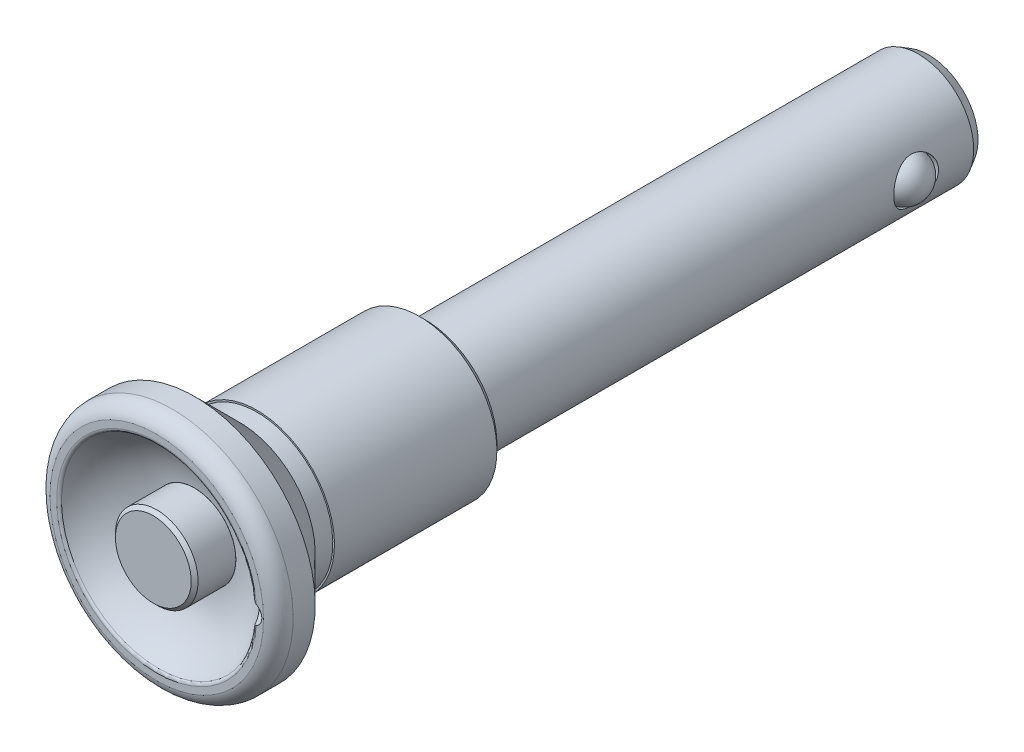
ISO-10303-21;
HEADER;
FILE_DESCRIPTION(('STEP AP214'),'2;1');
FILE_NAME('part.step','',(''),(''),'','','');
FILE_SCHEMA(('AUTOMOTIVE_DESIGN { 1 0 10303 214 1 1 1 1 }'));
ENDSEC;
DATA;
#1=APPLICATION_CONTEXT('core data for automotive mechanical design processes');
#2=APPLICATION_PROTOCOL_DEFINITION('international standard','automotive_design',2000,#1);
#3=PRODUCT_CONTEXT('',#1,'mechanical');
#4=PRODUCT('Part','Part','',(#3));
#5=PRODUCT_RELATED_PRODUCT_CATEGORY('part','',(#4));
#6=PRODUCT_DEFINITION_FORMATION('','',#4);
#7=PRODUCT_DEFINITION_CONTEXT('part definition',#1,'design');
#8=PRODUCT_DEFINITION('design','',#6,#7);
#9=PRODUCT_DEFINITION_SHAPE('','',#8);
#10=(LENGTH_UNIT() NAMED_UNIT(*) SI_UNIT(.MILLI.,.METRE.));
#11=(NAMED_UNIT(*) PLANE_ANGLE_UNIT() SI_UNIT($,.RADIAN.));
#12=(NAMED_UNIT(*) SI_UNIT($,.STERADIAN.) SOLID_ANGLE_UNIT());
#13=UNCERTAINTY_MEASURE_WITH_UNIT(LENGTH_MEASURE(1.E-05),#10,'distance_accuracy_value','');
#14=(GEOMETRIC_REPRESENTATION_CONTEXT(3) GLOBAL_UNCERTAINTY_ASSIGNED_CONTEXT((#13)) GLOBAL_UNIT_ASSIGNED_CONTEXT((#10,
#11,#12)) REPRESENTATION_CONTEXT('',''));
#15=CARTESIAN_POINT('',(0.,0.,0.));
#16=DIRECTION('',(0.,0.,1.));
#17=DIRECTION('',(1.,0.,0.));
#18=AXIS2_PLACEMENT_3D('',#15,#16,#17);
#19=CARTESIAN_POINT('',(9.,0.,-63.25));
#20=DIRECTION('',(1.,0.,0.));
#21=DIRECTION('',(0.,1.,0.));
#22=AXIS2_PLACEMENT_3D('',#19,#20,#21);
#23=CYLINDRICAL_SURFACE('',#22,3.25);
#24=CARTESIAN_POINT('',(-5.63465480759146,3.25,-63.25));
#25=CARTESIAN_POINT('',(-5.63465585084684,3.24999903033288,-63.3347265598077));
#26=CARTESIAN_POINT('',(-5.63657454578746,3.24668003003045,-63.4194635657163));
#27=CARTESIAN_POINT('',(-5.64416687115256,3.23345980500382,-63.5882644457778));
#28=CARTESIAN_POINT('',(-5.64984225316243,3.22355550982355,-63.6723279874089));
#29=CARTESIAN_POINT('',(-5.67225088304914,3.1840842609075,-63.9227685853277));
#30=CARTESIAN_POINT('',(-5.6943660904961,3.14475922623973,-64.0872467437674));
#31=CARTESIAN_POINT('',(-5.74975810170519,3.04227249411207,-64.4053993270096));
#32=CARTESIAN_POINT('',(-5.78297553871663,2.97923736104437,-64.5591260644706));
#33=CARTESIAN_POINT('',(-5.85672343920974,2.8315067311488,-64.8538197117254));
#34=CARTESIAN_POINT('',(-5.89725428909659,2.74681008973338,-64.994785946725));
#35=CARTESIAN_POINT('',(-5.98514477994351,2.54998143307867,-65.2727307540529));
#36=CARTESIAN_POINT('',(-6.03279191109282,2.4361644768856,-65.4084249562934));
#37=CARTESIAN_POINT('',(-6.12722511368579,2.18783002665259,-65.6597995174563));
#38=CARTESIAN_POINT('',(-6.17401074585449,2.05330228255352,-65.7754699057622));
#39=CARTESIAN_POINT('',(-6.26521517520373,1.75630332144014,-65.9911271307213));
#40=CARTESIAN_POINT('',(-6.30926291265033,1.59256097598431,-66.0895350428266));
#41=CARTESIAN_POINT('',(-6.38629670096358,1.24823211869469,-66.2568223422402));
#42=CARTESIAN_POINT('',(-6.41928971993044,1.06765630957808,-66.3257203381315));
#43=CARTESIAN_POINT('',(-6.46842511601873,0.708385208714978,-66.426948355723));
#44=CARTESIAN_POINT('',(-6.48559839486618,0.530468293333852,-66.4615292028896));
#45=CARTESIAN_POINT('',(-6.50500792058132,0.170592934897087,-66.5005535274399));
#46=CARTESIAN_POINT('',(-6.50725319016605,-0.0113630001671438,-66.5050152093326));
#47=CARTESIAN_POINT('',(-6.49704272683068,-0.357230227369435,-66.4845439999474));
#48=CARTESIAN_POINT('',(-6.4858466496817,-0.521336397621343,-66.4621299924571));
#49=CARTESIAN_POINT('',(-6.45191454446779,-0.843095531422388,-66.3930510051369));
#50=CARTESIAN_POINT('',(-6.42917765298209,-1.00074801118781,-66.3463842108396));
#51=CARTESIAN_POINT('',(-6.37385308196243,-1.30787680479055,-66.229819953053));
#52=CARTESIAN_POINT('',(-6.34113331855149,-1.45720962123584,-66.1596096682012));
#53=CARTESIAN_POINT('',(-6.26879358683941,-1.74233451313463,-65.9983862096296));
#54=CARTESIAN_POINT('',(-6.22917114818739,-1.87812171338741,-65.907365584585));
#55=CARTESIAN_POINT('',(-6.14233091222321,-2.14598519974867,-65.6972203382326));
#56=CARTESIAN_POINT('',(-6.09474919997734,-2.27650038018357,-65.5762535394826));
#57=CARTESIAN_POINT('',(-5.99975905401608,-2.51622424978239,-65.3146223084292));
#58=CARTESIAN_POINT('',(-5.95235078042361,-2.62541658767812,-65.1739429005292));
#59=CARTESIAN_POINT('',(-5.85980562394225,-2.82622074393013,-64.8657980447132));
#60=CARTESIAN_POINT('',(-5.81500282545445,-2.91628088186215,-64.6972003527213));
#61=CARTESIAN_POINT('',(-5.75683713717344,-3.02860289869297,-64.4329042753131));
#62=CARTESIAN_POINT('',(-5.73895226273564,-3.06225341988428,-64.3428861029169));
#63=CARTESIAN_POINT('',(-5.70689630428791,-3.12158760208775,-64.1596398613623));
#64=CARTESIAN_POINT('',(-5.69272293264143,-3.14727617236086,-64.0664138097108));
#65=CARTESIAN_POINT('',(-5.66966031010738,-3.18862076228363,-63.8849536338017));
#66=CARTESIAN_POINT('',(-5.66044290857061,-3.2049073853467,-63.7969042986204));
#67=CARTESIAN_POINT('',(-5.64606365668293,-3.23017214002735,-63.6194752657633));
#68=CARTESIAN_POINT('',(-5.64089969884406,-3.23915406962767,-63.5300962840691));
#69=CARTESIAN_POINT('',(-5.63484456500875,-3.24967714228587,-63.3507836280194));
#70=CARTESIAN_POINT('',(-5.63395180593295,-3.25122104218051,-63.2608501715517));
#71=CARTESIAN_POINT('',(-5.63646392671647,-3.24686086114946,-63.0812524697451));
#72=CARTESIAN_POINT('',(-5.63986851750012,-3.24095728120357,-62.9915882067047));
#73=CARTESIAN_POINT('',(-5.65514884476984,-3.21427724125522,-62.7437015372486));
#74=CARTESIAN_POINT('',(-5.67155983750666,-3.18549325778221,-62.5865355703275));
#75=CARTESIAN_POINT('',(-5.71556614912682,-3.10582623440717,-62.2796654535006));
#76=CARTESIAN_POINT('',(-5.74316508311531,-3.05493605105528,-62.1299637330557));
#77=CARTESIAN_POINT('',(-5.80791715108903,-2.93003236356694,-61.8342513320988));
#78=CARTESIAN_POINT('',(-5.84545364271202,-2.85505691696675,-61.6887328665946));
#79=CARTESIAN_POINT('',(-5.92551444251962,-2.68494755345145,-61.4115097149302));
#80=CARTESIAN_POINT('',(-5.96804130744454,-2.58980328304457,-61.2798121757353));
#81=CARTESIAN_POINT('',(-6.0597218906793,-2.36806394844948,-61.0166221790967));
#82=CARTESIAN_POINT('',(-6.10903611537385,-2.23901784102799,-60.8872408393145));
#83=CARTESIAN_POINT('',(-6.20410028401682,-1.9602691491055,-60.6513088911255));
#84=CARTESIAN_POINT('',(-6.24984902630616,-1.81055964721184,-60.5447659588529));
#85=CARTESIAN_POINT('',(-6.33418834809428,-1.48934321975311,-60.3551748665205));
#86=CARTESIAN_POINT('',(-6.3725595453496,-1.31736733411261,-60.2728167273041));
#87=CARTESIAN_POINT('',(-6.43615086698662,-0.959533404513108,-60.1390207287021));
#88=CARTESIAN_POINT('',(-6.46138252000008,-0.773687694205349,-60.0875557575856));
#89=CARTESIAN_POINT('',(-6.49401408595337,-0.411781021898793,-60.0214370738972));
#90=CARTESIAN_POINT('',(-6.50283657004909,-0.236384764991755,-60.0038414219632));
#91=CARTESIAN_POINT('',(-6.50610717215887,0.115050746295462,-59.9972911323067));
#92=CARTESIAN_POINT('',(-6.50056030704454,0.291089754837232,-60.0083264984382));
#93=CARTESIAN_POINT('',(-6.47654468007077,0.626628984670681,-60.0567749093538));
#94=CARTESIAN_POINT('',(-6.4589493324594,0.786455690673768,-60.0924062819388));
#95=CARTESIAN_POINT('',(-6.41341105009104,1.09760306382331,-60.1866353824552));
#96=CARTESIAN_POINT('',(-6.38546662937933,1.24892250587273,-60.2452364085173));
#97=CARTESIAN_POINT('',(-6.320263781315,1.54603651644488,-60.3863521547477));
#98=CARTESIAN_POINT('',(-6.28265782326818,1.69131721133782,-60.4697832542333));
#99=CARTESIAN_POINT('',(-6.20206440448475,1.96642117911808,-60.6570473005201));
#100=CARTESIAN_POINT('',(-6.15907447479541,2.09623730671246,-60.7608896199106));
#101=CARTESIAN_POINT('',(-6.06695065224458,2.35031327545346,-60.9979647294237));
#102=CARTESIAN_POINT('',(-6.01763078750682,2.4727384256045,-61.1330928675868));
#103=CARTESIAN_POINT('',(-5.92193632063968,2.69389263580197,-61.4228073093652));
#104=CARTESIAN_POINT('',(-5.87556434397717,2.79260078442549,-61.5774106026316));
#105=CARTESIAN_POINT('',(-5.81174828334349,2.9219570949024,-61.8239315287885));
#106=CARTESIAN_POINT('',(-5.7911601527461,2.96243340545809,-61.91000421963));
#107=CARTESIAN_POINT('',(-5.75300321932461,3.03586895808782,-62.0859253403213));
#108=CARTESIAN_POINT('',(-5.73543286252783,3.06883207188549,-62.175771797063));
#109=CARTESIAN_POINT('',(-5.70405555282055,3.12676668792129,-62.3583807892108));
#110=CARTESIAN_POINT('',(-5.69023892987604,3.15175875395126,-62.451135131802));
#111=CARTESIAN_POINT('',(-5.66692413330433,3.19349036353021,-62.6389664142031));
#112=CARTESIAN_POINT('',(-5.65742293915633,3.21023567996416,-62.7340416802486));
#113=CARTESIAN_POINT('',(-5.64512882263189,3.23178897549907,-62.8993457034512));
#114=CARTESIAN_POINT('',(-5.64121066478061,3.23861149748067,-62.9692357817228));
#115=CARTESIAN_POINT('',(-5.63597313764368,3.24771756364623,-63.1094148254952));
#116=CARTESIAN_POINT('',(-5.63465394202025,3.25000080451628,-63.1797038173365));
#117=CARTESIAN_POINT('',(-5.63465480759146,3.25,-63.25));
#118=B_SPLINE_CURVE_WITH_KNOTS('',3,(#24,#25,#26,#27,#28,#29,#30,#31,#32,#33,#34,#35,#36,#37,
#38,#39,#40,#41,#42,#43,#44,#45,#46,#47,#48,#49,#50,#51,#52,#53,#54,#55,#56,#57,#58,#59,#60,#61,
#62,#63,#64,#65,#66,#67,#68,#69,#70,#71,#72,#73,#74,#75,#76,#77,#78,#79,#80,#81,#82,#83,#84,#85,
#86,#87,#88,#89,#90,#91,#92,#93,#94,#95,#96,#97,#98,#99,#100,#101,#102,#103,#104,#105,#106,#107,
#108,#109,#110,#111,#112,#113,#114,#115,#116,#117),.UNSPECIFIED.,.T.,.F.,(4,2,2,2,2,2,2,2,2,2,2,
2,2,2,2,2,2,2,2,2,2,2,2,2,2,2,2,2,2,2,2,2,2,2,2,2,2,2,2,2,2,2,2,2,2,2,4),(0.,0.254102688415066,
0.508323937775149,1.01720671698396,1.52341076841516,2.0296415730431,2.5775608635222,
3.1257522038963,3.71082834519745,4.29553499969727,4.8386878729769,5.38151242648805,
5.87719988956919,6.37292444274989,6.87551542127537,7.37828663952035,7.92853225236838,
8.47919817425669,9.06474424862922,9.35763698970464,9.65034877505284,9.92001687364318,
10.1895446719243,10.4589725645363,10.7283823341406,11.2078563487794,11.6874854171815,
12.189332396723,12.6914376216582,13.2567245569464,13.8222011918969,14.4025190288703,
14.982326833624,15.5089851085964,16.0354595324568,16.5273252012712,17.0192615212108,
17.5322584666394,18.045491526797,18.6097361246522,19.1744764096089,19.4660899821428,
19.7575529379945,20.0482577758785,20.3387588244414,20.5495694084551,20.7603940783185),.UNSPECIFIED.);
#119=CARTESIAN_POINT('',(-6.04146080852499,-2.41093054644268,-65.429429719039));
#120=VERTEX_POINT('',#119);
#121=CARTESIAN_POINT('',(-6.04146080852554,2.41093054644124,-65.4294297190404));
#122=VERTEX_POINT('',#121);
#123=EDGE_CURVE('E78',#120,#122,#118,.T.);
#124=ORIENTED_EDGE('',*,*,#123,.F.);
#125=CARTESIAN_POINT('',(-6.50475478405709,0.,-66.5));
#126=CARTESIAN_POINT('',(-6.50475472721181,-0.182431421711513,-66.4999918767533));
#127=CARTESIAN_POINT('',(-6.50415200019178,-0.364995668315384,-66.4845876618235));
#128=CARTESIAN_POINT('',(-6.50173100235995,-0.725096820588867,-66.4233526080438));
#129=CARTESIAN_POINT('',(-6.49991125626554,-0.902627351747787,-66.3774848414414));
#130=CARTESIAN_POINT('',(-6.49502786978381,-1.24739374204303,-66.2566336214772));
#131=CARTESIAN_POINT('',(-6.49196480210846,-1.41463430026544,-66.1816635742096));
#132=CARTESIAN_POINT('',(-6.48454055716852,-1.7340906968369,-66.0047703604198));
#133=CARTESIAN_POINT('',(-6.48017978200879,-1.88631116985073,-65.9028555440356));
#134=CARTESIAN_POINT('',(-6.47005616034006,-2.17150162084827,-65.6749545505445));
#135=CARTESIAN_POINT('',(-6.46429309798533,-2.30446863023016,-65.5489646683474));
#136=CARTESIAN_POINT('',(-6.45117895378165,-2.54740669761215,-65.2764608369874));
#137=CARTESIAN_POINT('',(-6.44382727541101,-2.65736908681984,-65.129939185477));
#138=CARTESIAN_POINT('',(-6.42714023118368,-2.85122292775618,-64.8204831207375));
#139=CARTESIAN_POINT('',(-6.41780288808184,-2.935088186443,-64.6575324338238));
#140=CARTESIAN_POINT('',(-6.39637595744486,-3.07415122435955,-64.3201765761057));
#141=CARTESIAN_POINT('',(-6.3842904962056,-3.12939158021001,-64.1457888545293));
#142=CARTESIAN_POINT('',(-6.36213145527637,-3.18943231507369,-63.8809438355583));
#143=CARTESIAN_POINT('',(-6.35414445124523,-3.20560626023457,-63.7927604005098));
#144=CARTESIAN_POINT('',(-6.33542581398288,-3.23060141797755,-63.6156617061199));
#145=CARTESIAN_POINT('',(-6.32469468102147,-3.239423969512,-63.5267465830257));
#146=CARTESIAN_POINT('',(-6.30342598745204,-3.24711535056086,-63.3937912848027));
#147=CARTESIAN_POINT('',(-6.29549176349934,-3.24875723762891,-63.3496150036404));
#148=CARTESIAN_POINT('',(-6.27882947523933,-3.24969197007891,-63.2959956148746));
#149=CARTESIAN_POINT('',(-6.27515773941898,-3.24982305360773,-63.285346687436));
#150=CARTESIAN_POINT('',(-6.26890017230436,-3.24992109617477,-63.272794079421));
#151=CARTESIAN_POINT('',(-6.26755615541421,-3.24993748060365,-63.2703066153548));
#152=CARTESIAN_POINT('',(-6.26457757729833,-3.24996385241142,-63.2655076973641));
#153=CARTESIAN_POINT('',(-6.26294427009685,-3.24997386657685,-63.2631955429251));
#154=CARTESIAN_POINT('',(-6.26029966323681,-3.2499838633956,-63.2602771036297));
#155=CARTESIAN_POINT('',(-6.25950365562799,-3.24998625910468,-63.259480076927));
#156=CARTESIAN_POINT('',(-6.25780472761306,-3.24999021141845,-63.2580094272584));
#157=CARTESIAN_POINT('',(-6.25690222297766,-3.24999177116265,-63.2573353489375));
#158=CARTESIAN_POINT('',(-6.25538170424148,-3.24999365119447,-63.2564327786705));
#159=CARTESIAN_POINT('',(-6.25480452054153,-3.2499942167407,-63.2561363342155));
#160=CARTESIAN_POINT('',(-6.25361148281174,-3.2499951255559,-63.2556343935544));
#161=CARTESIAN_POINT('',(-6.25299567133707,-3.24999546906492,-63.2554287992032));
#162=CARTESIAN_POINT('',(-6.25172949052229,-3.2499959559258,-63.2551293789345));
#163=CARTESIAN_POINT('',(-6.25107882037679,-3.24999609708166,-63.2550367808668));
#164=CARTESIAN_POINT('',(-6.24977202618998,-3.24999618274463,-63.2549813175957));
#165=CARTESIAN_POINT('',(-6.24911590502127,-3.24999612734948,-63.2550183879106));
#166=CARTESIAN_POINT('',(-6.24790373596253,-3.24999583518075,-63.2552035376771));
#167=CARTESIAN_POINT('',(-6.2473453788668,-3.24999562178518,-63.2553372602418));
#168=CARTESIAN_POINT('',(-6.2462549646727,-3.24999503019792,-63.2556861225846));
#169=CARTESIAN_POINT('',(-6.24572292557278,-3.24999465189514,-63.2559013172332));
#170=CARTESIAN_POINT('',(-6.24435696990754,-3.24999341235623,-63.2565561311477));
#171=CARTESIAN_POINT('',(-6.24354975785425,-3.24999239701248,-63.2570509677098));
#172=CARTESIAN_POINT('',(-6.24201857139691,-3.24998981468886,-63.2581558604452));
#173=CARTESIAN_POINT('',(-6.24129488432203,-3.24998824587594,-63.2587662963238));
#174=CARTESIAN_POINT('',(-6.23885580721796,-3.24998160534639,-63.2610537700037));
#175=CARTESIAN_POINT('',(-6.23732819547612,-3.24997485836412,-63.2629265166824));
#176=CARTESIAN_POINT('',(-6.23453858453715,-3.24995689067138,-63.2668604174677));
#177=CARTESIAN_POINT('',(-6.23327848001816,-3.24994563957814,-63.2689227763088));
#178=CARTESIAN_POINT('',(-6.2275407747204,-3.24987933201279,-63.2791362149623));
#179=CARTESIAN_POINT('',(-6.22414293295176,-3.24979089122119,-63.2878680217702));
#180=CARTESIAN_POINT('',(-6.21809518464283,-3.24953787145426,-63.3055431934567));
#181=CARTESIAN_POINT('',(-6.21544772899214,-3.24937304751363,-63.3144871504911));
#182=CARTESIAN_POINT('',(-6.20329024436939,-3.24836406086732,-63.359005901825));
#183=CARTESIAN_POINT('',(-6.19656627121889,-3.24694993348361,-63.3953332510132));
#184=CARTESIAN_POINT('',(-6.18452276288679,-3.24287823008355,-63.4681644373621));
#185=CARTESIAN_POINT('',(-6.17920844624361,-3.24021613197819,-63.5046684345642));
#186=CARTESIAN_POINT('',(-6.16455650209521,-3.23031427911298,-63.6146776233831));
#187=CARTESIAN_POINT('',(-6.15659209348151,-3.22116857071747,-63.6882307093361));
#188=CARTESIAN_POINT('',(-6.14213641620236,-3.19786349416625,-63.8345240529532));
#189=CARTESIAN_POINT('',(-6.13564314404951,-3.1837110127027,-63.907265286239));
#190=CARTESIAN_POINT('',(-6.11756290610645,-3.13371051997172,-64.1243002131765));
#191=CARTESIAN_POINT('',(-6.10741258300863,-3.09035068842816,-64.2670577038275));
#192=CARTESIAN_POINT('',(-6.08705596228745,-2.97250185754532,-64.5766439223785));
#193=CARTESIAN_POINT('',(-6.07734814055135,-2.89321109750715,-64.7416864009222));
#194=CARTESIAN_POINT('',(-6.0600012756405,-2.70803402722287,-65.0561997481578));
#195=CARTESIAN_POINT('',(-6.05236213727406,-2.60214894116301,-65.205671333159));
#196=CARTESIAN_POINT('',(-6.03871394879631,-2.36675113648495,-65.4847978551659));
#197=CARTESIAN_POINT('',(-6.03270506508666,-2.23723600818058,-65.6144507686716));
#198=CARTESIAN_POINT('',(-6.02211352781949,-1.95825322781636,-65.8502113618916));
#199=CARTESIAN_POINT('',(-6.01753088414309,-1.80878543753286,-65.9563188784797));
#200=CARTESIAN_POINT('',(-6.00967850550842,-1.4941417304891,-66.1419551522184));
#201=CARTESIAN_POINT('',(-6.00640873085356,-1.32896628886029,-66.2214847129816));
#202=CARTESIAN_POINT('',(-6.00112064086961,-0.987593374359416,-66.3516982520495));
#203=CARTESIAN_POINT('',(-5.99910232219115,-0.811395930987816,-66.4023823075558));
#204=CARTESIAN_POINT('',(-5.99628586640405,-0.453052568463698,-66.4734446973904));
#205=CARTESIAN_POINT('',(-5.99548726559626,-0.270908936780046,-66.4938345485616));
#206=CARTESIAN_POINT('',(-5.99509745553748,0.0942183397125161,-66.5037635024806));
#207=CARTESIAN_POINT('',(-5.99550624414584,0.277201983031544,-66.4933026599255));
#208=CARTESIAN_POINT('',(-5.99753672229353,0.638781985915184,-66.4418331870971));
#209=CARTESIAN_POINT('',(-5.99915820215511,0.817379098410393,-66.4008298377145));
#210=CARTESIAN_POINT('',(-6.00363843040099,1.16515467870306,-66.2894496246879));
#211=CARTESIAN_POINT('',(-6.00649721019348,1.33433290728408,-66.2190720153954));
#212=CARTESIAN_POINT('',(-6.0135025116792,1.65849568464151,-66.0509346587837));
#213=CARTESIAN_POINT('',(-6.01764926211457,1.81347770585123,-65.9531700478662));
#214=CARTESIAN_POINT('',(-6.0273234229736,2.1047933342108,-65.7330763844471));
#215=CARTESIAN_POINT('',(-6.03285058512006,2.24113028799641,-65.6107517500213));
#216=CARTESIAN_POINT('',(-6.04544982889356,2.49132905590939,-65.3450117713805));
#217=CARTESIAN_POINT('',(-6.05252187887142,2.60519133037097,-65.2015968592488));
#218=CARTESIAN_POINT('',(-6.06857069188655,2.8073171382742,-64.8976741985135));
#219=CARTESIAN_POINT('',(-6.07754918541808,2.8955572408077,-64.7371509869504));
#220=CARTESIAN_POINT('',(-6.09807707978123,3.04397016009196,-64.4033061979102));
#221=CARTESIAN_POINT('',(-6.10963108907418,3.10409205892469,-64.2299620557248));
#222=CARTESIAN_POINT('',(-6.13064936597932,3.17169375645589,-63.9649701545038));
#223=CARTESIAN_POINT('',(-6.13825974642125,3.19045596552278,-63.8759096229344));
#224=CARTESIAN_POINT('',(-6.15556946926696,3.22042544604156,-63.6967504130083));
#225=CARTESIAN_POINT('',(-6.16526748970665,3.23163748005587,-63.6066524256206));
#226=CARTESIAN_POINT('',(-6.18408699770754,3.24288271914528,-63.4699792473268));
#227=CARTESIAN_POINT('',(-6.19122596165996,3.24569959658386,-63.4233942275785));
#228=CARTESIAN_POINT('',(-6.20522823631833,3.24841427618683,-63.3541203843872));
#229=CARTESIAN_POINT('',(-6.21044556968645,3.24906738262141,-63.3311266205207));
#230=CARTESIAN_POINT('',(-6.22071764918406,3.24967689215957,-63.2971645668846));
#231=CARTESIAN_POINT('',(-6.22455261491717,3.24981834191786,-63.2859249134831));
#232=CARTESIAN_POINT('',(-6.23115042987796,3.24992193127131,-63.2726935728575));
#233=CARTESIAN_POINT('',(-6.23257343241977,3.24993908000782,-63.2700667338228));
#234=CARTESIAN_POINT('',(-6.23574861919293,3.249966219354,-63.2650204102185));
#235=CARTESIAN_POINT('',(-6.23749823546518,3.24997626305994,-63.262599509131));
#236=CARTESIAN_POINT('',(-6.24023323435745,3.24998546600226,-63.2597477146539));
#237=CARTESIAN_POINT('',(-6.24095037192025,3.24998741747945,-63.2590662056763));
#238=CARTESIAN_POINT('',(-6.24247036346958,3.2499906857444,-63.2578055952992));
#239=CARTESIAN_POINT('',(-6.24327303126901,3.24999200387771,-63.2572262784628));
#240=CARTESIAN_POINT('',(-6.24469100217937,3.24999372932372,-63.2563932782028));
#241=CARTESIAN_POINT('',(-6.24527994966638,3.24999429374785,-63.2560953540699));
#242=CARTESIAN_POINT('',(-6.24649738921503,3.24999519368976,-63.2555949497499));
#243=CARTESIAN_POINT('',(-6.24712582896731,3.24999552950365,-63.2553923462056));
#244=CARTESIAN_POINT('',(-6.24841731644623,3.24999599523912,-63.2551042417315));
#245=CARTESIAN_POINT('',(-6.24908067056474,3.24999612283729,-63.2550200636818));
#246=CARTESIAN_POINT('',(-6.25041071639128,3.24999617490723,-63.2549864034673));
#247=CARTESIAN_POINT('',(-6.25107740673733,3.24999609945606,-63.2550368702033));
#248=CARTESIAN_POINT('',(-6.2522960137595,3.24999576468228,-63.2552474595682));
#249=CARTESIAN_POINT('',(-6.25285091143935,3.24999553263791,-63.2553912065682));
#250=CARTESIAN_POINT('',(-6.25393339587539,3.24999490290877,-63.2557583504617));
#251=CARTESIAN_POINT('',(-6.25446096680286,3.24999450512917,-63.25598179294));
#252=CARTESIAN_POINT('',(-6.25583840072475,3.24999318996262,-63.256667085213));
#253=CARTESIAN_POINT('',(-6.256659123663,3.24999210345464,-63.2571869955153));
#254=CARTESIAN_POINT('',(-6.2582140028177,3.24998934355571,-63.2583432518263));
#255=CARTESIAN_POINT('',(-6.2589478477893,3.24998766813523,-63.2589799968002));
#256=CARTESIAN_POINT('',(-6.26145971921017,3.24998046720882,-63.2613987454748));
#257=CARTESIAN_POINT('',(-6.2630348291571,3.2499730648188,-63.2633865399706));
#258=CARTESIAN_POINT('',(-6.26590679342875,3.24995329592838,-63.2675538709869));
#259=CARTESIAN_POINT('',(-6.26720163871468,3.24994089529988,-63.269734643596));
#260=CARTESIAN_POINT('',(-6.27320326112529,3.24986641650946,-63.2807202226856));
#261=CARTESIAN_POINT('',(-6.27673982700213,3.24976552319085,-63.2901364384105));
#262=CARTESIAN_POINT('',(-6.28303094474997,3.24947572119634,-63.3091775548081));
#263=CARTESIAN_POINT('',(-6.28578309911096,3.24928654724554,-63.3188030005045));
#264=CARTESIAN_POINT('',(-6.29841795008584,3.24812694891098,-63.3667085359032));
#265=CARTESIAN_POINT('',(-6.30538389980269,3.24649816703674,-63.4057506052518));
#266=CARTESIAN_POINT('',(-6.31786268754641,3.24180659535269,-63.4839948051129));
#267=CARTESIAN_POINT('',(-6.32337031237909,3.23873876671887,-63.5231970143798));
#268=CARTESIAN_POINT('',(-6.33857182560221,3.22731083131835,-63.6414665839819));
#269=CARTESIAN_POINT('',(-6.34682941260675,3.21674112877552,-63.7205459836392));
#270=CARTESIAN_POINT('',(-6.36180806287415,3.18980788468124,-63.8776933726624));
#271=CARTESIAN_POINT('',(-6.36853100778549,3.17345150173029,-63.9557624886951));
#272=CARTESIAN_POINT('',(-6.38722831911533,3.11568291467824,-64.1883617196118));
#273=CARTESIAN_POINT('',(-6.39769866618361,3.0656017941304,-64.3409675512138));
#274=CARTESIAN_POINT('',(-6.41649095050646,2.94356822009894,-64.6369097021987));
#275=CARTESIAN_POINT('',(-6.42481661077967,2.87165414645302,-64.7802617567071));
#276=CARTESIAN_POINT('',(-6.4398810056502,2.70750791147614,-65.0548470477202));
#277=CARTESIAN_POINT('',(-6.44662026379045,2.61528247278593,-65.1860842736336));
#278=CARTESIAN_POINT('',(-6.45968563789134,2.39819149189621,-65.4510135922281));
#279=CARTESIAN_POINT('',(-6.46582082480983,2.27056101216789,-65.58246220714));
#280=CARTESIAN_POINT('',(-6.47665599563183,1.99493696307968,-65.82218121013));
#281=CARTESIAN_POINT('',(-6.4813549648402,1.84692910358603,-65.9304351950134));
#282=CARTESIAN_POINT('',(-6.4894329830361,1.53479241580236,-66.1205971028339));
#283=CARTESIAN_POINT('',(-6.49281172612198,1.37065986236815,-66.2024989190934));
#284=CARTESIAN_POINT('',(-6.49830922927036,1.03110256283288,-66.3374958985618));
#285=CARTESIAN_POINT('',(-6.50042961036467,0.85569266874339,-66.3906281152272));
#286=CARTESIAN_POINT('',(-6.50287966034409,0.565964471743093,-66.4523665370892));
#287=CARTESIAN_POINT('',(-6.50358302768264,0.453533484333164,-66.4702066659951));
#288=CARTESIAN_POINT('',(-6.50452060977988,0.227418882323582,-66.4940259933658));
#289=CARTESIAN_POINT('',(-6.50475481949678,0.113735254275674,-66.5000050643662));
#290=CARTESIAN_POINT('',(-6.50475478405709,0.,-66.5));
#291=B_SPLINE_CURVE_WITH_KNOTS('',3,(#125,#126,#127,#128,#129,#130,#131,#132,#133,#134,#135,
#136,#137,#138,#139,#140,#141,#142,#143,#144,#145,#146,#147,#148,#149,#150,#151,#152,#153,#154,
#155,#156,#157,#158,#159,#160,#161,#162,#163,#164,#165,#166,#167,#168,#169,#170,#171,#172,#173,
#174,#175,#176,#177,#178,#179,#180,#181,#182,#183,#184,#185,#186,#187,#188,#189,#190,#191,#192,
#193,#194,#195,#196,#197,#198,#199,#200,#201,#202,#203,#204,#205,#206,#207,#208,#209,#210,#211,
#212,#213,#214,#215,#216,#217,#218,#219,#220,#221,#222,#223,#224,#225,#226,#227,#228,#229,#230,
#231,#232,#233,#234,#235,#236,#237,#238,#239,#240,#241,#242,#243,#244,#245,#246,#247,#248,#249,
#250,#251,#252,#253,#254,#255,#256,#257,#258,#259,#260,#261,#262,#263,#264,#265,#266,#267,#268,
#269,#270,#271,#272,#273,#274,#275,#276,#277,#278,#279,#280,#281,#282,#283,#284,#285,#286,#287,
#288,#289,#290),.UNSPECIFIED.,.T.,.F.,(4,2,2,2,2,2,2,2,2,2,2,2,2,2,2,2,2,2,2,2,2,2,2,2,2,2,2,2,
2,2,2,2,2,2,2,2,2,2,2,2,2,2,2,2,2,2,2,2,2,2,2,2,2,2,2,2,2,2,2,2,2,2,2,2,2,2,2,2,2,2,2,2,2,2,2,2,
2,2,2,2,2,2,4),(0.,0.546878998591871,1.09442213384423,1.64171333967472,2.18883513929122,
2.73604120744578,3.28345310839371,3.83141267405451,4.37855484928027,4.64829359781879,
4.91798320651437,5.05238497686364,5.08600715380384,5.09448207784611,5.1029211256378,
5.10629355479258,5.10965322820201,5.11159396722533,5.11353260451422,5.11549212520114,
5.11745067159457,5.11916600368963,5.12088249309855,5.12370644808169,5.12653984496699,
5.13373370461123,5.14097693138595,5.16888967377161,5.19689256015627,5.30747569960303,
5.41846267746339,5.64180446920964,5.86484024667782,6.31195514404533,6.85939401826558,
7.40680769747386,7.95427723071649,8.50175055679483,9.04920732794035,9.59666263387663,
10.1439097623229,10.6911559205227,11.2383074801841,11.7854729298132,12.3327356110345,
12.879899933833,13.427053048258,13.9747049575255,14.5233447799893,14.7970709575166,
15.0706243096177,15.2120965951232,15.2828520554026,15.3182754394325,15.3272316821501,
15.3361202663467,15.3390824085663,15.3420382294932,15.3440119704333,15.3459831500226,
15.3479761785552,15.3499684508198,15.3516812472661,15.3533950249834,15.3562927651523,
15.3592005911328,15.3667496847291,15.3743512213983,15.4043178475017,15.4343751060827,
15.5531053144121,15.672254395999,15.912531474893,16.1525123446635,16.6334226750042,
17.1134924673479,17.5934036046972,18.1407106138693,18.688403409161,19.2362230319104,
19.7833354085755,20.1242786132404,20.465225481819),.UNSPECIFIED.);
#292=EDGE_CURVE('E62',#122,#120,#291,.T.);
#293=ORIENTED_EDGE('',*,*,#292,.F.);
#294=EDGE_LOOP('',(#124,#293));
#295=FACE_BOUND('',#294,.T.);
#296=CARTESIAN_POINT('',(-7.31009575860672,3.25,-63.25));
#297=CARTESIAN_POINT('',(-7.31009732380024,3.24999819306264,-63.1630599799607));
#298=CARTESIAN_POINT('',(-7.31165386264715,3.24650411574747,-63.076090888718));
#299=CARTESIAN_POINT('',(-7.31782159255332,3.23257358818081,-62.9028024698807));
#300=CARTESIAN_POINT('',(-7.3224347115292,3.22213275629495,-62.8164835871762));
#301=CARTESIAN_POINT('',(-7.34068494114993,3.18046303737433,-62.5591175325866));
#302=CARTESIAN_POINT('',(-7.35873227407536,3.13888730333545,-62.3899262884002));
#303=CARTESIAN_POINT('',(-7.40417815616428,3.03010582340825,-62.062264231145));
#304=CARTESIAN_POINT('',(-7.43153982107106,2.96300104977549,-61.903754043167));
#305=CARTESIAN_POINT('',(-7.49246721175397,2.80536216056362,-61.6002509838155));
#306=CARTESIAN_POINT('',(-7.52603125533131,2.71483439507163,-61.4552544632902));
#307=CARTESIAN_POINT('',(-7.59780469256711,2.50719740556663,-61.174284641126));
#308=CARTESIAN_POINT('',(-7.63616661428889,2.38892405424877,-61.0392107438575));
#309=CARTESIAN_POINT('',(-7.71195570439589,2.13160039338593,-60.790151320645));
#310=CARTESIAN_POINT('',(-7.74938251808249,1.99254233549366,-60.6761736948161));
#311=CARTESIAN_POINT('',(-7.82092244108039,1.69061377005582,-60.4680431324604));
#312=CARTESIAN_POINT('',(-7.85483757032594,1.52700226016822,-60.3748909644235));
#313=CARTESIAN_POINT('',(-7.91367836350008,1.18480623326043,-60.2178173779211));
#314=CARTESIAN_POINT('',(-7.93860783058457,1.00622809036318,-60.1538835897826));
#315=CARTESIAN_POINT('',(-7.97558858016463,0.648594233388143,-60.0602869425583));
#316=CARTESIAN_POINT('',(-7.98821898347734,0.470004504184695,-60.0290769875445));
#317=CARTESIAN_POINT('',(-8.00127556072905,0.109705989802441,-59.9968257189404));
#318=CARTESIAN_POINT('',(-8.00170642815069,-0.0720015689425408,-59.9957728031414));
#319=CARTESIAN_POINT('',(-7.99066355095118,-0.422169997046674,-60.0230312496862));
#320=CARTESIAN_POINT('',(-7.97987772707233,-0.5907886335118,-60.0496457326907));
#321=CARTESIAN_POINT('',(-7.94854711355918,-0.92092632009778,-60.1285888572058));
#322=CARTESIAN_POINT('',(-7.92800160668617,-1.08244484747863,-60.1809193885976));
#323=CARTESIAN_POINT('',(-7.87875951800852,-1.39673026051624,-60.3104453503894));
#324=CARTESIAN_POINT('',(-7.84994411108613,-1.54932739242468,-60.3880056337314));
#325=CARTESIAN_POINT('',(-7.78700709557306,-1.83973693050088,-60.5654420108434));
#326=CARTESIAN_POINT('',(-7.75288364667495,-1.97754418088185,-60.6653258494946));
#327=CARTESIAN_POINT('',(-7.68006213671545,-2.2443353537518,-60.8924212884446));
#328=CARTESIAN_POINT('',(-7.6412107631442,-2.37209684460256,-61.0210218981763));
#329=CARTESIAN_POINT('',(-7.56507027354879,-2.60475126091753,-61.2979515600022));
#330=CARTESIAN_POINT('',(-7.52778170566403,-2.70963621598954,-61.4462874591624));
#331=CARTESIAN_POINT('',(-7.45792668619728,-2.89648137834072,-61.7641116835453));
#332=CARTESIAN_POINT('',(-7.42553491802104,-2.97766171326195,-61.9341001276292));
#333=CARTESIAN_POINT('',(-7.37120049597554,-3.10975325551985,-62.2870012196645));
#334=CARTESIAN_POINT('',(-7.34925080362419,-3.16068485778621,-62.4699050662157));
#335=CARTESIAN_POINT('',(-7.32000769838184,-3.22780941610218,-62.8312282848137));
#336=CARTESIAN_POINT('',(-7.31188362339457,-3.24597550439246,-63.009212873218));
#337=CARTESIAN_POINT('',(-7.30884184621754,-3.25282336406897,-63.365834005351));
#338=CARTESIAN_POINT('',(-7.31391993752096,-3.24151452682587,-63.544470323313));
#339=CARTESIAN_POINT('',(-7.33585566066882,-3.19153169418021,-63.8861339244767));
#340=CARTESIAN_POINT('',(-7.35199401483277,-3.15452692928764,-64.0494573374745));
#341=CARTESIAN_POINT('',(-7.39332962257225,-3.05638531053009,-64.3674592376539));
#342=CARTESIAN_POINT('',(-7.41852892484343,-2.99524299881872,-64.5221357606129));
#343=CARTESIAN_POINT('',(-7.47641704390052,-2.84775217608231,-64.8255746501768));
#344=CARTESIAN_POINT('',(-7.50937194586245,-2.76046786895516,-64.9738297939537));
#345=CARTESIAN_POINT('',(-7.57866264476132,-2.56411776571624,-65.2542780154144));
#346=CARTESIAN_POINT('',(-7.61499984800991,-2.4550428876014,-65.3864643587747));
#347=CARTESIAN_POINT('',(-7.69032288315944,-2.20834452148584,-65.6415580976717));
#348=CARTESIAN_POINT('',(-7.72929827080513,-2.06917373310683,-65.7629779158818));
#349=CARTESIAN_POINT('',(-7.80289864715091,-1.77151095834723,-65.9809844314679));
#350=CARTESIAN_POINT('',(-7.83752340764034,-1.6130179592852,-66.0775698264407));
#351=CARTESIAN_POINT('',(-7.89867149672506,-1.28045225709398,-66.2428966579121));
#352=CARTESIAN_POINT('',(-7.9251887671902,-1.10636802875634,-66.311617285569));
#353=CARTESIAN_POINT('',(-7.96701679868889,-0.747763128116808,-66.4183263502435));
#354=CARTESIAN_POINT('',(-7.98233386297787,-0.563248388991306,-66.4563320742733));
#355=CARTESIAN_POINT('',(-7.99934332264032,-0.202353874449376,-66.4984343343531));
#356=CARTESIAN_POINT('',(-8.00187969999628,-0.0262571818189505,-66.5046318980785));
#357=CARTESIAN_POINT('',(-7.99534247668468,0.324389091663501,-66.4885273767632));
#358=CARTESIAN_POINT('',(-7.98627073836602,0.498938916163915,-66.4662298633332));
#359=CARTESIAN_POINT('',(-7.95796712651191,0.835717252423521,-66.3952733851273));
#360=CARTESIAN_POINT('',(-7.93907454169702,0.998161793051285,-66.3474934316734));
#361=CARTESIAN_POINT('',(-7.89317001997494,1.31268916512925,-66.2278639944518));
#362=CARTESIAN_POINT('',(-7.86615650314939,1.46476997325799,-66.1560098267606));
#363=CARTESIAN_POINT('',(-7.80514921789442,1.76171759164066,-65.9866698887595));
#364=CARTESIAN_POINT('',(-7.77089769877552,1.90595939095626,-65.8881831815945));
#365=CARTESIAN_POINT('',(-7.69951725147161,2.176473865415,-65.6698538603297));
#366=CARTESIAN_POINT('',(-7.66238732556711,2.30274026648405,-65.5500038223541));
#367=CARTESIAN_POINT('',(-7.5864657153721,2.54210677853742,-65.2833069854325));
#368=CARTESIAN_POINT('',(-7.54772000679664,2.65384474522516,-65.1352223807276));
#369=CARTESIAN_POINT('',(-7.47545536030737,2.85108049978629,-64.8210469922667));
#370=CARTESIAN_POINT('',(-7.44193927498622,2.93656399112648,-64.6549464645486));
#371=CARTESIAN_POINT('',(-7.3989625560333,3.04249490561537,-64.3964499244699));
#372=CARTESIAN_POINT('',(-7.38588609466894,3.0740182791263,-64.3090459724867));
#373=CARTESIAN_POINT('',(-7.36253208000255,3.12954209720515,-64.1315309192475));
#374=CARTESIAN_POINT('',(-7.35225317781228,3.15354616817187,-64.0414211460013));
#375=CARTESIAN_POINT('',(-7.3348971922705,3.19370630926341,-63.8594307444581));
#376=CARTESIAN_POINT('',(-7.32781154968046,3.20988336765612,-63.7675555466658));
#377=CARTESIAN_POINT('',(-7.31707726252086,3.23427923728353,-63.5826022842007));
#378=CARTESIAN_POINT('',(-7.31342609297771,3.24250389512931,-63.4895251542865));
#379=CARTESIAN_POINT('',(-7.31058346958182,3.24890274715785,-63.3475459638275));
#380=CARTESIAN_POINT('',(-7.31009488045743,3.25000101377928,-63.2987775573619));
#381=CARTESIAN_POINT('',(-7.31009575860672,3.25,-63.25));
#382=B_SPLINE_CURVE_WITH_KNOTS('',3,(#296,#297,#298,#299,#300,#301,#302,#303,#304,#305,#306,
#307,#308,#309,#310,#311,#312,#313,#314,#315,#316,#317,#318,#319,#320,#321,#322,#323,#324,#325,
#326,#327,#328,#329,#330,#331,#332,#333,#334,#335,#336,#337,#338,#339,#340,#341,#342,#343,#344,
#345,#346,#347,#348,#349,#350,#351,#352,#353,#354,#355,#356,#357,#358,#359,#360,#361,#362,#363,
#364,#365,#366,#367,#368,#369,#370,#371,#372,#373,#374,#375,#376,#377,#378,#379,#380,#381),
.UNSPECIFIED.,.T.,.F.,(4,2,2,2,2,2,2,2,2,2,2,2,2,2,2,2,2,2,2,2,2,2,2,2,2,2,2,2,2,2,2,2,2,2,2,2,
2,2,2,2,2,2,4),(0.,0.260777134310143,0.521718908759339,1.04438772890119,1.56501043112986,
2.08549213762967,2.63385451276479,3.18242182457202,3.75341190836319,4.32416003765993,
4.8665061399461,5.40864358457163,5.91938723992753,6.43016843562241,6.94869149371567,
7.46739472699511,8.02109099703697,8.57497987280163,9.14544243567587,9.71551993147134,
10.2499491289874,10.7842080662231,11.2866605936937,11.7892267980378,12.3125257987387,
12.8360433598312,13.3996836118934,13.9633534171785,14.5274433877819,15.091215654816,
15.6172206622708,16.1431412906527,16.6519938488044,17.1609454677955,17.6926147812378,
18.2244692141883,18.7904042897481,19.3566469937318,19.6378242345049,19.9188656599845,
20.1991492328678,20.4792265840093,20.6255351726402),.UNSPECIFIED.);
#383=CARTESIAN_POINT('',(-7.31009575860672,3.25,-63.25));
#384=VERTEX_POINT('',#383);
#385=EDGE_CURVE('E69',#384,#384,#382,.T.);
#386=ORIENTED_EDGE('',*,*,#385,.F.);
#387=EDGE_LOOP('',(#386));
#388=FACE_BOUND('',#387,.T.);
#389=ADVANCED_FACE('F14',(#295,#388),#23,.F.);
#390=CARTESIAN_POINT('',(0.,0.,-73.1));
#391=DIRECTION('',(0.,0.,-1.));
#392=DIRECTION('',(0.,1.,0.));
#393=AXIS2_PLACEMENT_3D('',#390,#391,#392);
#394=CYLINDRICAL_SURFACE('',#393,3.);
#395=CARTESIAN_POINT('',(0.,0.,-67.6));
#396=DIRECTION('',(0.,0.,-1.));
#397=DIRECTION('',(0.,1.,0.));
#398=AXIS2_PLACEMENT_3D('',#395,#396,#397);
#399=CIRCLE('',#398,3.);
#400=CARTESIAN_POINT('',(0.,3.,-67.6));
#401=VERTEX_POINT('',#400);
#402=EDGE_CURVE('E9',#401,#401,#399,.T.);
#403=ORIENTED_EDGE('',*,*,#402,.F.);
#404=EDGE_LOOP('',(#403));
#405=FACE_BOUND('',#404,.T.);
#406=CARTESIAN_POINT('',(0.,0.,-73.1));
#407=DIRECTION('',(0.,0.,-1.));
#408=DIRECTION('',(0.,1.,0.));
#409=AXIS2_PLACEMENT_3D('',#406,#407,#408);
#410=CIRCLE('',#409,3.);
#411=CARTESIAN_POINT('',(0.,3.,-73.1));
#412=VERTEX_POINT('',#411);
#413=EDGE_CURVE('E307',#412,#412,#410,.T.);
#414=ORIENTED_EDGE('',*,*,#413,.T.);
#415=EDGE_LOOP('',(#414));
#416=FACE_BOUND('',#415,.T.);
#417=ADVANCED_FACE('F272',(#405,#416),#394,.F.);
#418=CARTESIAN_POINT('',(0.,0.,-73.1));
#419=DIRECTION('',(0.,0.,-1.));
#420=DIRECTION('',(0.,1.,0.));
#421=AXIS2_PLACEMENT_3D('',#418,#419,#420);
#422=CYLINDRICAL_SURFACE('',#421,8.);
#423=CARTESIAN_POINT('',(7.31009575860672,3.25,-63.25));
#424=CARTESIAN_POINT('',(7.31009732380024,3.24999819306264,-63.3369400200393));
#425=CARTESIAN_POINT('',(7.31165386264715,3.24650411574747,-63.423909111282));
#426=CARTESIAN_POINT('',(7.31782159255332,3.23257358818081,-63.5971975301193));
#427=CARTESIAN_POINT('',(7.3224347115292,3.22213275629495,-63.6835164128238));
#428=CARTESIAN_POINT('',(7.34068494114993,3.18046303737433,-63.9408824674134));
#429=CARTESIAN_POINT('',(7.35873227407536,3.13888730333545,-64.1100737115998));
#430=CARTESIAN_POINT('',(7.40417815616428,3.03010582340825,-64.437735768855));
#431=CARTESIAN_POINT('',(7.43153982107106,2.96300104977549,-64.596245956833));
#432=CARTESIAN_POINT('',(7.49246721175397,2.80536216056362,-64.8997490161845));
#433=CARTESIAN_POINT('',(7.5260312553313,2.71483439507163,-65.0447455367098));
#434=CARTESIAN_POINT('',(7.59780469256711,2.50719740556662,-65.325715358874));
#435=CARTESIAN_POINT('',(7.6361666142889,2.38892405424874,-65.4607892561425));
#436=CARTESIAN_POINT('',(7.71195570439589,2.13160039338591,-65.7098486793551));
#437=CARTESIAN_POINT('',(7.74938251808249,1.99254233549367,-65.823826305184));
#438=CARTESIAN_POINT('',(7.82092244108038,1.69061377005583,-66.0319568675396));
#439=CARTESIAN_POINT('',(7.85483757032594,1.52700226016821,-66.1251090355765));
#440=CARTESIAN_POINT('',(7.91367836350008,1.18480623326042,-66.2821826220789));
#441=CARTESIAN_POINT('',(7.93860783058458,1.00622809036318,-66.3461164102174));
#442=CARTESIAN_POINT('',(7.97558858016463,0.648594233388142,-66.4397130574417));
#443=CARTESIAN_POINT('',(7.98821898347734,0.470004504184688,-66.4709230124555));
#444=CARTESIAN_POINT('',(8.00127556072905,0.109705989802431,-66.5031742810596));
#445=CARTESIAN_POINT('',(8.00170642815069,-0.0720015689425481,-66.5042271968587));
#446=CARTESIAN_POINT('',(7.99066355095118,-0.42216999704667,-66.4769687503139));
#447=CARTESIAN_POINT('',(7.97987772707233,-0.590788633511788,-66.4503542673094));
#448=CARTESIAN_POINT('',(7.94854711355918,-0.920926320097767,-66.3714111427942));
#449=CARTESIAN_POINT('',(7.92800160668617,-1.08244484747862,-66.3190806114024));
#450=CARTESIAN_POINT('',(7.87875951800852,-1.39673026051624,-66.1895546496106));
#451=CARTESIAN_POINT('',(7.84994411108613,-1.54932739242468,-66.1119943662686));
#452=CARTESIAN_POINT('',(7.78700709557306,-1.83973693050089,-65.9345579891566));
#453=CARTESIAN_POINT('',(7.75288364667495,-1.97754418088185,-65.8346741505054));
#454=CARTESIAN_POINT('',(7.68006213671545,-2.2443353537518,-65.6075787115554));
#455=CARTESIAN_POINT('',(7.6412107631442,-2.37209684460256,-65.4789781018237));
#456=CARTESIAN_POINT('',(7.56507027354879,-2.60475126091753,-65.2020484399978));
#457=CARTESIAN_POINT('',(7.52778170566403,-2.70963621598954,-65.0537125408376));
#458=CARTESIAN_POINT('',(7.45792668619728,-2.89648137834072,-64.7358883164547));
#459=CARTESIAN_POINT('',(7.42553491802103,-2.97766171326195,-64.5658998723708));
#460=CARTESIAN_POINT('',(7.37120049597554,-3.10975325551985,-64.2129987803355));
#461=CARTESIAN_POINT('',(7.34925080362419,-3.16068485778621,-64.0300949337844));
#462=CARTESIAN_POINT('',(7.32000769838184,-3.22780941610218,-63.6687717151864));
#463=CARTESIAN_POINT('',(7.31188362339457,-3.24597550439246,-63.4907871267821));
#464=CARTESIAN_POINT('',(7.30884184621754,-3.25282336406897,-63.1341659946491));
#465=CARTESIAN_POINT('',(7.31391993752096,-3.24151452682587,-62.9555296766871));
#466=CARTESIAN_POINT('',(7.33585566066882,-3.19153169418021,-62.6138660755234));
#467=CARTESIAN_POINT('',(7.35199401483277,-3.15452692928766,-62.4505426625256));
#468=CARTESIAN_POINT('',(7.39332962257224,-3.0563853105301,-62.1325407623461));
#469=CARTESIAN_POINT('',(7.41852892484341,-2.99524299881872,-61.9778642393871));
#470=CARTESIAN_POINT('',(7.47641704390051,-2.84775217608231,-61.6744253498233));
#471=CARTESIAN_POINT('',(7.50937194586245,-2.76046786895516,-61.5261702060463));
#472=CARTESIAN_POINT('',(7.57866264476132,-2.56411776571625,-61.2457219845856));
#473=CARTESIAN_POINT('',(7.61499984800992,-2.4550428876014,-61.1135356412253));
#474=CARTESIAN_POINT('',(7.69032288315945,-2.20834452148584,-60.8584419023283));
#475=CARTESIAN_POINT('',(7.72929827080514,-2.06917373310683,-60.7370220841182));
#476=CARTESIAN_POINT('',(7.80289864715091,-1.77151095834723,-60.519015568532));
#477=CARTESIAN_POINT('',(7.83752340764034,-1.6130179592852,-60.4224301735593));
#478=CARTESIAN_POINT('',(7.89867149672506,-1.28045225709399,-60.2571033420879));
#479=CARTESIAN_POINT('',(7.9251887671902,-1.10636802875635,-60.188382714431));
#480=CARTESIAN_POINT('',(7.96701679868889,-0.747763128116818,-60.0816736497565));
#481=CARTESIAN_POINT('',(7.98233386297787,-0.563248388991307,-60.0436679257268));
#482=CARTESIAN_POINT('',(7.99934332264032,-0.202353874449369,-60.0015656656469));
#483=CARTESIAN_POINT('',(8.00187969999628,-0.0262571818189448,-59.9953681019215));
#484=CARTESIAN_POINT('',(7.99534247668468,0.324389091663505,-60.0114726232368));
#485=CARTESIAN_POINT('',(7.98627073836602,0.498938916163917,-60.0337701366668));
#486=CARTESIAN_POINT('',(7.95796712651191,0.835717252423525,-60.1047266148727));
#487=CARTESIAN_POINT('',(7.93907454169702,0.998161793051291,-60.1525065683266));
#488=CARTESIAN_POINT('',(7.89317001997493,1.31268916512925,-60.2721360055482));
#489=CARTESIAN_POINT('',(7.86615650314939,1.46476997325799,-60.3439901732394));
#490=CARTESIAN_POINT('',(7.80514921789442,1.76171759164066,-60.5133301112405));
#491=CARTESIAN_POINT('',(7.77089769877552,1.90595939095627,-60.6118168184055));
#492=CARTESIAN_POINT('',(7.69951725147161,2.176473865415,-60.8301461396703));
#493=CARTESIAN_POINT('',(7.66238732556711,2.30274026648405,-60.9499961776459));
#494=CARTESIAN_POINT('',(7.58646571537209,2.54210677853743,-61.2166930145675));
#495=CARTESIAN_POINT('',(7.54772000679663,2.6538447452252,-61.3647776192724));
#496=CARTESIAN_POINT('',(7.47545536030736,2.8510804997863,-61.6789530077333));
#497=CARTESIAN_POINT('',(7.44193927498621,2.93656399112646,-61.8450535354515));
#498=CARTESIAN_POINT('',(7.39896255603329,3.04249490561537,-62.1035500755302));
#499=CARTESIAN_POINT('',(7.38588609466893,3.07401827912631,-62.1909540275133));
#500=CARTESIAN_POINT('',(7.36253208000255,3.12954209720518,-62.3684690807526));
#501=CARTESIAN_POINT('',(7.35225317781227,3.15354616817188,-62.4585788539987));
#502=CARTESIAN_POINT('',(7.33489719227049,3.19370630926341,-62.640569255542));
#503=CARTESIAN_POINT('',(7.32781154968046,3.20988336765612,-62.7324444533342));
#504=CARTESIAN_POINT('',(7.31707726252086,3.23427923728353,-62.9173977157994));
#505=CARTESIAN_POINT('',(7.31342609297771,3.24250389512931,-63.0104748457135));
#506=CARTESIAN_POINT('',(7.31058346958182,3.24890274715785,-63.1524540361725));
#507=CARTESIAN_POINT('',(7.31009488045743,3.25000101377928,-63.2012224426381));
#508=CARTESIAN_POINT('',(7.31009575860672,3.25,-63.25));
#509=B_SPLINE_CURVE_WITH_KNOTS('',3,(#423,#424,#425,#426,#427,#428,#429,#430,#431,#432,#433,
#434,#435,#436,#437,#438,#439,#440,#441,#442,#443,#444,#445,#446,#447,#448,#449,#450,#451,#452,
#453,#454,#455,#456,#457,#458,#459,#460,#461,#462,#463,#464,#465,#466,#467,#468,#469,#470,#471,
#472,#473,#474,#475,#476,#477,#478,#479,#480,#481,#482,#483,#484,#485,#486,#487,#488,#489,#490,
#491,#492,#493,#494,#495,#496,#497,#498,#499,#500,#501,#502,#503,#504,#505,#506,#507,#508),
.UNSPECIFIED.,.T.,.F.,(4,2,2,2,2,2,2,2,2,2,2,2,2,2,2,2,2,2,2,2,2,2,2,2,2,2,2,2,2,2,2,2,2,2,2,2,
2,2,2,2,2,2,4),(0.,0.260777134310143,0.521718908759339,1.0443877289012,1.56501043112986,
2.08549213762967,2.63385451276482,3.18242182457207,3.75341190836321,4.32416003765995,
4.86650613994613,5.40864358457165,5.91938723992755,6.43016843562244,6.94869149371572,
7.46739472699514,8.021090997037,8.57497987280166,9.14544243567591,9.71551993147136,
10.2499491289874,10.784208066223,11.2866605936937,11.7892267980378,12.3125257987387,
12.8360433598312,13.3996836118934,13.9633534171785,14.5274433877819,15.0912156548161,
15.6172206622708,16.1431412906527,16.6519938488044,17.1609454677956,17.6926147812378,
18.2244692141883,18.7904042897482,19.3566469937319,19.637824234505,19.9188656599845,
20.1991492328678,20.4792265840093,20.6255351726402),.UNSPECIFIED.);
#510=CARTESIAN_POINT('',(7.31009575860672,3.25,-63.25));
#511=VERTEX_POINT('',#510);
#512=EDGE_CURVE('E292',#511,#511,#509,.T.);
#513=ORIENTED_EDGE('',*,*,#512,.T.);
#514=EDGE_LOOP('',(#513));
#515=FACE_BOUND('',#514,.T.);
#516=CARTESIAN_POINT('',(0.,0.,-71.6));
#517=DIRECTION('',(0.,0.,-1.));
#518=DIRECTION('',(0.,1.,0.));
#519=AXIS2_PLACEMENT_3D('',#516,#517,#518);
#520=CIRCLE('',#519,8.);
#521=CARTESIAN_POINT('',(0.,8.,-71.6));
#522=VERTEX_POINT('',#521);
#523=EDGE_CURVE('E75',#522,#522,#520,.T.);
#524=ORIENTED_EDGE('',*,*,#523,.F.);
#525=EDGE_LOOP('',(#524));
#526=FACE_BOUND('',#525,.T.);
#527=ORIENTED_EDGE('',*,*,#385,.T.);
#528=EDGE_LOOP('',(#527));
#529=FACE_BOUND('',#528,.T.);
#530=CARTESIAN_POINT('',(0.,0.,0.));
#531=DIRECTION('',(0.,0.,1.));
#532=DIRECTION('',(1.,0.,0.));
#533=AXIS2_PLACEMENT_3D('',#530,#531,#532);
#534=CIRCLE('',#533,8.);
#535=CARTESIAN_POINT('',(8.,0.,0.));
#536=VERTEX_POINT('',#535);
#537=EDGE_CURVE('E81',#536,#536,#534,.T.);
#538=ORIENTED_EDGE('',*,*,#537,.F.);
#539=EDGE_LOOP('',(#538));
#540=FACE_BOUND('',#539,.T.);
#541=ADVANCED_FACE('F269',(#515,#526,#529,#540),#422,.T.);
#542=CARTESIAN_POINT('',(3.,0.,-73.1));
#543=DIRECTION('',(0.,0.,-1.));
#544=DIRECTION('',(0.,1.,0.));
#545=AXIS2_PLACEMENT_3D('',#542,#543,#544);
#546=PLANE('',#545);
#547=CARTESIAN_POINT('',(0.,0.,-73.1));
#548=DIRECTION('',(0.,0.,-1.));
#549=DIRECTION('',(0.,1.,0.));
#550=AXIS2_PLACEMENT_3D('',#547,#548,#549);
#551=CIRCLE('',#550,7.13397459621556);
#552=CARTESIAN_POINT('',(0.,7.13397459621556,-73.1));
#553=VERTEX_POINT('',#552);
#554=EDGE_CURVE('E310',#553,#553,#551,.T.);
#555=ORIENTED_EDGE('',*,*,#554,.T.);
#556=EDGE_LOOP('',(#555));
#557=FACE_BOUND('',#556,.T.);
#558=ORIENTED_EDGE('',*,*,#413,.F.);
#559=EDGE_LOOP('',(#558));
#560=FACE_BOUND('',#559,.T.);
#561=ADVANCED_FACE('F271',(#557,#560),#546,.T.);
#562=CARTESIAN_POINT('',(0.,0.,-73.1));
#563=DIRECTION('',(0.,0.,1.));
#564=DIRECTION('',(0.,-1.,0.));
#565=AXIS2_PLACEMENT_3D('',#562,#563,#564);
#566=CONICAL_SURFACE('',#565,7.13397459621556,0.523598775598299);
#567=ORIENTED_EDGE('',*,*,#523,.T.);
#568=EDGE_LOOP('',(#567));
#569=FACE_BOUND('',#568,.T.);
#570=ORIENTED_EDGE('',*,*,#554,.F.);
#571=EDGE_LOOP('',(#570));
#572=FACE_BOUND('',#571,.T.);
#573=ADVANCED_FACE('F280',(#569,#572),#566,.T.);
#574=CARTESIAN_POINT('',(5.63465480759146,3.25,-63.25));
#575=CARTESIAN_POINT('',(5.63465585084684,3.24999903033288,-63.1652734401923));
#576=CARTESIAN_POINT('',(5.63657454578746,3.24668003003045,-63.0805364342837));
#577=CARTESIAN_POINT('',(5.64416687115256,3.23345980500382,-62.9117355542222));
#578=CARTESIAN_POINT('',(5.64984225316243,3.22355550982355,-62.8276720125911));
#579=CARTESIAN_POINT('',(5.67225088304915,3.18408426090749,-62.5772314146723));
#580=CARTESIAN_POINT('',(5.6943660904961,3.14475922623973,-62.4127532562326));
#581=CARTESIAN_POINT('',(5.74975810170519,3.04227249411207,-62.0946006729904));
#582=CARTESIAN_POINT('',(5.78297553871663,2.97923736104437,-61.9408739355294));
#583=CARTESIAN_POINT('',(5.85672343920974,2.83150673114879,-61.6461802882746));
#584=CARTESIAN_POINT('',(5.89725428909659,2.74681008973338,-61.505214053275));
#585=CARTESIAN_POINT('',(5.98514477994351,2.54998143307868,-61.2272692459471));
#586=CARTESIAN_POINT('',(6.03279191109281,2.43616447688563,-61.0915750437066));
#587=CARTESIAN_POINT('',(6.12722511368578,2.18783002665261,-60.8402004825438));
#588=CARTESIAN_POINT('',(6.17401074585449,2.05330228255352,-60.7245300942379));
#589=CARTESIAN_POINT('',(6.26521517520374,1.75630332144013,-60.5088728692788));
#590=CARTESIAN_POINT('',(6.30926291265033,1.59256097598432,-60.4104649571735));
#591=CARTESIAN_POINT('',(6.38629670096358,1.24823211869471,-60.2431776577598));
#592=CARTESIAN_POINT('',(6.41928971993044,1.06765630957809,-60.1742796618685));
#593=CARTESIAN_POINT('',(6.46842511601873,0.708385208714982,-60.073051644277));
#594=CARTESIAN_POINT('',(6.48559839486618,0.530468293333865,-60.0384707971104));
#595=CARTESIAN_POINT('',(6.50500792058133,0.170592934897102,-59.9994464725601));
#596=CARTESIAN_POINT('',(6.50725319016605,-0.0113630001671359,-59.9949847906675));
#597=CARTESIAN_POINT('',(6.49704272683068,-0.357230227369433,-60.0154560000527));
#598=CARTESIAN_POINT('',(6.4858466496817,-0.521336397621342,-60.037870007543));
#599=CARTESIAN_POINT('',(6.45191454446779,-0.843095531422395,-60.1069489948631));
#600=CARTESIAN_POINT('',(6.42917765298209,-1.00074801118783,-60.1536157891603));
#601=CARTESIAN_POINT('',(6.37385308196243,-1.30787680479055,-60.2701800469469));
#602=CARTESIAN_POINT('',(6.3411333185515,-1.45720962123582,-60.3403903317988));
#603=CARTESIAN_POINT('',(6.26879358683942,-1.7423345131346,-60.5016137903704));
#604=CARTESIAN_POINT('',(6.22917114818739,-1.8781217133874,-60.592634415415));
#605=CARTESIAN_POINT('',(6.14233091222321,-2.14598519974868,-60.8027796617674));
#606=CARTESIAN_POINT('',(6.09474919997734,-2.27650038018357,-60.9237464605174));
#607=CARTESIAN_POINT('',(5.99975905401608,-2.5162242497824,-61.1853776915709));
#608=CARTESIAN_POINT('',(5.95235078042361,-2.62541658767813,-61.3260570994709));
#609=CARTESIAN_POINT('',(5.85980562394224,-2.82622074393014,-61.6342019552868));
#610=CARTESIAN_POINT('',(5.81500282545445,-2.91628088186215,-61.8027996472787));
#611=CARTESIAN_POINT('',(5.75683713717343,-3.02860289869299,-62.0670957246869));
#612=CARTESIAN_POINT('',(5.73895226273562,-3.06225341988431,-62.1571138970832));
#613=CARTESIAN_POINT('',(5.7068963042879,-3.12158760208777,-62.3403601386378));
#614=CARTESIAN_POINT('',(5.69272293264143,-3.14727617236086,-62.4335861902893));
#615=CARTESIAN_POINT('',(5.66966031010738,-3.18862076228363,-62.6150463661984));
#616=CARTESIAN_POINT('',(5.6604429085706,-3.20490738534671,-62.7030957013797));
#617=CARTESIAN_POINT('',(5.64606365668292,-3.23017214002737,-62.8805247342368));
#618=CARTESIAN_POINT('',(5.64089969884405,-3.23915406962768,-62.969903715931));
#619=CARTESIAN_POINT('',(5.63484456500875,-3.24967714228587,-63.1492163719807));
#620=CARTESIAN_POINT('',(5.63395180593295,-3.25122104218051,-63.2391498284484));
#621=CARTESIAN_POINT('',(5.63646392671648,-3.24686086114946,-63.418747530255));
#622=CARTESIAN_POINT('',(5.63986851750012,-3.24095728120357,-63.5084117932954));
#623=CARTESIAN_POINT('',(5.65514884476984,-3.21427724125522,-63.7562984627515));
#624=CARTESIAN_POINT('',(5.67155983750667,-3.1854932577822,-63.9134644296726));
#625=CARTESIAN_POINT('',(5.71556614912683,-3.10582623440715,-64.2203345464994));
#626=CARTESIAN_POINT('',(5.74316508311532,-3.05493605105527,-64.3700362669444));
#627=CARTESIAN_POINT('',(5.80791715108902,-2.93003236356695,-64.6657486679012));
#628=CARTESIAN_POINT('',(5.84545364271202,-2.85505691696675,-64.8112671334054));
#629=CARTESIAN_POINT('',(5.92551444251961,-2.68494755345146,-65.0884902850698));
#630=CARTESIAN_POINT('',(5.96804130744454,-2.58980328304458,-65.2201878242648));
#631=CARTESIAN_POINT('',(6.05972189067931,-2.36806394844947,-65.4833778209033));
#632=CARTESIAN_POINT('',(6.10903611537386,-2.23901784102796,-65.6127591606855));
#633=CARTESIAN_POINT('',(6.20410028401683,-1.96026914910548,-65.8486911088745));
#634=CARTESIAN_POINT('',(6.24984902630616,-1.81055964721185,-65.9552340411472));
#635=CARTESIAN_POINT('',(6.33418834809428,-1.48934321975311,-66.1448251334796));
#636=CARTESIAN_POINT('',(6.3725595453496,-1.3173673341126,-66.227183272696));
#637=CARTESIAN_POINT('',(6.43615086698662,-0.959533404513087,-66.3609792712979));
#638=CARTESIAN_POINT('',(6.46138252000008,-0.77368769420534,-66.4124442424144));
#639=CARTESIAN_POINT('',(6.49401408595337,-0.411781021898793,-66.4785629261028));
#640=CARTESIAN_POINT('',(6.50283657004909,-0.236384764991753,-66.4961585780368));
#641=CARTESIAN_POINT('',(6.50610717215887,0.115050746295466,-66.5027088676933));
#642=CARTESIAN_POINT('',(6.50056030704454,0.291089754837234,-66.4916735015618));
#643=CARTESIAN_POINT('',(6.47654468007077,0.62662898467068,-66.4432250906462));
#644=CARTESIAN_POINT('',(6.4589493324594,0.786455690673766,-66.4075937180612));
#645=CARTESIAN_POINT('',(6.41341105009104,1.09760306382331,-66.3133646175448));
#646=CARTESIAN_POINT('',(6.38546662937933,1.24892250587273,-66.2547635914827));
#647=CARTESIAN_POINT('',(6.32026378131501,1.54603651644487,-66.1136478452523));
#648=CARTESIAN_POINT('',(6.28265782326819,1.69131721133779,-66.0302167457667));
#649=CARTESIAN_POINT('',(6.20206440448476,1.96642117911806,-65.84295269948));
#650=CARTESIAN_POINT('',(6.15907447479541,2.09623730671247,-65.7391103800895));
#651=CARTESIAN_POINT('',(6.06695065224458,2.35031327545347,-65.5020352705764));
#652=CARTESIAN_POINT('',(6.01763078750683,2.47273842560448,-65.3669071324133));
#653=CARTESIAN_POINT('',(5.92193632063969,2.69389263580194,-65.0771926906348));
#654=CARTESIAN_POINT('',(5.87556434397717,2.79260078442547,-64.9225893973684));
#655=CARTESIAN_POINT('',(5.81174828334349,2.92195709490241,-64.6760684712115));
#656=CARTESIAN_POINT('',(5.7911601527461,2.96243340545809,-64.58999578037));
#657=CARTESIAN_POINT('',(5.75300321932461,3.03586895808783,-64.4140746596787));
#658=CARTESIAN_POINT('',(5.73543286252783,3.06883207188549,-64.324228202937));
#659=CARTESIAN_POINT('',(5.70405555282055,3.12676668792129,-64.1416192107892));
#660=CARTESIAN_POINT('',(5.69023892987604,3.15175875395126,-64.048864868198));
#661=CARTESIAN_POINT('',(5.66692413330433,3.19349036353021,-63.8610335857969));
#662=CARTESIAN_POINT('',(5.65742293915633,3.21023567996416,-63.7659583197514));
#663=CARTESIAN_POINT('',(5.64512882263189,3.23178897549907,-63.6006542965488));
#664=CARTESIAN_POINT('',(5.64121066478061,3.23861149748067,-63.5307642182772));
#665=CARTESIAN_POINT('',(5.63597313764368,3.24771756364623,-63.3905851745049));
#666=CARTESIAN_POINT('',(5.63465394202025,3.25000080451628,-63.3202961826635));
#667=CARTESIAN_POINT('',(5.63465480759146,3.25,-63.25));
#668=B_SPLINE_CURVE_WITH_KNOTS('',3,(#574,#575,#576,#577,#578,#579,#580,#581,#582,#583,#584,
#585,#586,#587,#588,#589,#590,#591,#592,#593,#594,#595,#596,#597,#598,#599,#600,#601,#602,#603,
#604,#605,#606,#607,#608,#609,#610,#611,#612,#613,#614,#615,#616,#617,#618,#619,#620,#621,#622,
#623,#624,#625,#626,#627,#628,#629,#630,#631,#632,#633,#634,#635,#636,#637,#638,#639,#640,#641,
#642,#643,#644,#645,#646,#647,#648,#649,#650,#651,#652,#653,#654,#655,#656,#657,#658,#659,#660,
#661,#662,#663,#664,#665,#666,#667),.UNSPECIFIED.,.T.,.F.,(4,2,2,2,2,2,2,2,2,2,2,2,2,2,2,2,2,2,
2,2,2,2,2,2,2,2,2,2,2,2,2,2,2,2,2,2,2,2,2,2,2,2,2,2,2,2,4),(0.,0.254102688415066,
0.50832393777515,1.01720671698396,1.52341076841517,2.0296415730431,2.57756086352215,
3.12575220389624,3.71082834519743,4.29553499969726,4.83868787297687,5.38151242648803,
5.87719988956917,6.37292444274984,6.87551542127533,7.37828663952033,7.92853225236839,
8.47919817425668,9.06474424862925,9.3576369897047,9.65034877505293,9.92001687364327,
10.1895446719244,10.4589725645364,10.7283823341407,11.2078563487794,11.6874854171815,
12.189332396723,12.6914376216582,13.2567245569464,13.8222011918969,14.4025190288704,
14.982326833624,15.5089851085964,16.0354595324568,16.5273252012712,17.0192615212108,
17.5322584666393,18.0454915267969,18.6097361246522,19.1744764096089,19.4660899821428,
19.7575529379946,20.0482577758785,20.3387588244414,20.5495694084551,20.7603940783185),.UNSPECIFIED.);
#669=CARTESIAN_POINT('',(6.04146080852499,2.41093054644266,-65.4294297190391));
#670=VERTEX_POINT('',#669);
#671=CARTESIAN_POINT('',(6.04146080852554,-2.41093054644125,-65.4294297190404));
#672=VERTEX_POINT('',#671);
#673=EDGE_CURVE('E71',#670,#672,#668,.T.);
#674=ORIENTED_EDGE('',*,*,#673,.F.);
#675=CARTESIAN_POINT('',(6.50475478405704,0.,-66.5));
#676=CARTESIAN_POINT('',(6.50475472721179,0.182431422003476,-66.4999918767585));
#677=CARTESIAN_POINT('',(6.50415200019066,0.364995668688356,-66.4845876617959));
#678=CARTESIAN_POINT('',(6.50173100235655,0.725096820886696,-66.4233526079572));
#679=CARTESIAN_POINT('',(6.49991125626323,0.902627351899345,-66.3774848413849));
#680=CARTESIAN_POINT('',(6.49502786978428,1.24739374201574,-66.2566336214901));
#681=CARTESIAN_POINT('',(6.49196480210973,1.41463430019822,-66.1816635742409));
#682=CARTESIAN_POINT('',(6.48454055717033,1.73409069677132,-66.004770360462));
#683=CARTESIAN_POINT('',(6.48017978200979,1.88631116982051,-65.9028555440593));
#684=CARTESIAN_POINT('',(6.47005616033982,2.17150162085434,-65.6749545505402));
#685=CARTESIAN_POINT('',(6.4642930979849,2.30446863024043,-65.5489646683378));
#686=CARTESIAN_POINT('',(6.45117895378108,2.54740669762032,-65.2764608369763));
#687=CARTESIAN_POINT('',(6.44382727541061,2.65736908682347,-65.1299391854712));
#688=CARTESIAN_POINT('',(6.42714023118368,2.85122292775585,-64.8204831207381));
#689=CARTESIAN_POINT('',(6.41780288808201,2.93508818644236,-64.657532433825));
#690=CARTESIAN_POINT('',(6.39637595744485,3.07415122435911,-64.3201765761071));
#691=CARTESIAN_POINT('',(6.3842904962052,3.12939158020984,-64.1457888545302));
#692=CARTESIAN_POINT('',(6.36213145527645,3.18943231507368,-63.8809438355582));
#693=CARTESIAN_POINT('',(6.35414445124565,3.20560626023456,-63.7927604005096));
#694=CARTESIAN_POINT('',(6.33542581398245,3.23060141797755,-63.6156617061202));
#695=CARTESIAN_POINT('',(6.32469468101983,3.23942396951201,-63.5267465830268));
#696=CARTESIAN_POINT('',(6.3034259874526,3.24711535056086,-63.3937912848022));
#697=CARTESIAN_POINT('',(6.29549176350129,3.2487572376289,-63.3496150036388));
#698=CARTESIAN_POINT('',(6.27882947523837,3.24969197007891,-63.2959956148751));
#699=CARTESIAN_POINT('',(6.27515773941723,3.24982305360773,-63.2853466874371));
#700=CARTESIAN_POINT('',(6.26890017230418,3.24992109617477,-63.272794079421));
#701=CARTESIAN_POINT('',(6.26755615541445,3.24993748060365,-63.2703066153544));
#702=CARTESIAN_POINT('',(6.26457757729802,3.24996385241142,-63.2655076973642));
#703=CARTESIAN_POINT('',(6.26294427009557,3.24997386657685,-63.263195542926));
#704=CARTESIAN_POINT('',(6.26029966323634,3.2499838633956,-63.2602771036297));
#705=CARTESIAN_POINT('',(6.25950365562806,3.24998625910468,-63.2594800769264));
#706=CARTESIAN_POINT('',(6.25780472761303,3.24999021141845,-63.2580094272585));
#707=CARTESIAN_POINT('',(6.25690222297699,3.24999177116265,-63.2573353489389));
#708=CARTESIAN_POINT('',(6.25538170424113,3.24999365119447,-63.2564327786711));
#709=CARTESIAN_POINT('',(6.25480452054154,3.2499942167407,-63.2561363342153));
#710=CARTESIAN_POINT('',(6.25361148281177,3.2499951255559,-63.2556343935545));
#711=CARTESIAN_POINT('',(6.25299567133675,3.24999546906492,-63.2554287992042));
#712=CARTESIAN_POINT('',(6.25172949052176,3.2499959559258,-63.2551293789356));
#713=CARTESIAN_POINT('',(6.25107882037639,3.24999609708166,-63.2550367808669));
#714=CARTESIAN_POINT('',(6.24977202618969,3.24999618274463,-63.2549813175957));
#715=CARTESIAN_POINT('',(6.24911590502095,3.24999612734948,-63.2550183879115));
#716=CARTESIAN_POINT('',(6.24790373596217,3.24999583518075,-63.2552035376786));
#717=CARTESIAN_POINT('',(6.24734537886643,3.24999562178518,-63.255337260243));
#718=CARTESIAN_POINT('',(6.24625496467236,3.24999503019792,-63.2556861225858));
#719=CARTESIAN_POINT('',(6.24572292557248,3.24999465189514,-63.2559013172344));
#720=CARTESIAN_POINT('',(6.24435696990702,3.24999341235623,-63.2565561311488));
#721=CARTESIAN_POINT('',(6.2435497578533,3.24999239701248,-63.2570509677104));
#722=CARTESIAN_POINT('',(6.24201857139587,3.24998981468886,-63.2581558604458));
#723=CARTESIAN_POINT('',(6.24129488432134,3.24998824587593,-63.258766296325));
#724=CARTESIAN_POINT('',(6.23885580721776,3.24998160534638,-63.2610537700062));
#725=CARTESIAN_POINT('',(6.237328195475,3.24997485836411,-63.2629265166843));
#726=CARTESIAN_POINT('',(6.23453858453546,3.24995689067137,-63.2668604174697));
#727=CARTESIAN_POINT('',(6.23327848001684,3.24994563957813,-63.2689227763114));
#728=CARTESIAN_POINT('',(6.22754077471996,3.24987933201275,-63.2791362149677));
#729=CARTESIAN_POINT('',(6.22414293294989,3.24979089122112,-63.2878680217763));
#730=CARTESIAN_POINT('',(6.21809518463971,3.24953787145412,-63.305543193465));
#731=CARTESIAN_POINT('',(6.2154477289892,3.24937304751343,-63.3144871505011));
#732=CARTESIAN_POINT('',(6.20329024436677,3.2483640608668,-63.359005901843));
#733=CARTESIAN_POINT('',(6.19656627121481,3.24694993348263,-63.3953332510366));
#734=CARTESIAN_POINT('',(6.18452276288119,3.24287823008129,-63.4681644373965));
#735=CARTESIAN_POINT('',(6.17920844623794,3.2402161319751,-63.5046684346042));
#736=CARTESIAN_POINT('',(6.1645565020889,3.23031427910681,-63.6146776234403));
#737=CARTESIAN_POINT('',(6.15659209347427,3.22116857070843,-63.6882307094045));
#738=CARTESIAN_POINT('',(6.14213641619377,3.19786349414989,-63.8345240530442));
#739=CARTESIAN_POINT('',(6.1356431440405,3.18371101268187,-63.9072652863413));
#740=CARTESIAN_POINT('',(6.11756290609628,3.13371051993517,-64.1243002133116));
#741=CARTESIAN_POINT('',(6.10741258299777,3.09035068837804,-64.2670577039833));
#742=CARTESIAN_POINT('',(6.08705596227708,2.97250185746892,-64.5766439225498));
#743=CARTESIAN_POINT('',(6.07734814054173,2.89321109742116,-64.7416864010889));
#744=CARTESIAN_POINT('',(6.06000127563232,2.70803402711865,-65.056199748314));
#745=CARTESIAN_POINT('',(6.05236213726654,2.60214894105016,-65.2056713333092));
#746=CARTESIAN_POINT('',(6.03871394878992,2.36675113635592,-65.4847978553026));
#747=CARTESIAN_POINT('',(6.03270506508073,2.237236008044,-65.6144507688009));
#748=CARTESIAN_POINT('',(6.02211352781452,1.95825322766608,-65.8502113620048));
#749=CARTESIAN_POINT('',(6.01753088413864,1.80878543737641,-65.9563188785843));
#750=CARTESIAN_POINT('',(6.00967850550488,1.49414173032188,-66.1419551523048));
#751=CARTESIAN_POINT('',(6.00640873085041,1.32896628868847,-66.2214847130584));
#752=CARTESIAN_POINT('',(6.00112064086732,0.987593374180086,-66.3516982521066));
#753=CARTESIAN_POINT('',(5.99910232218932,0.811395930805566,-66.4023823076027));
#754=CARTESIAN_POINT('',(5.99628586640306,0.453052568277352,-66.4734446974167));
#755=CARTESIAN_POINT('',(5.99548726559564,0.270908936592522,-66.4938345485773));
#756=CARTESIAN_POINT('',(5.9950974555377,-0.0942183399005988,-66.5037635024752));
#757=CARTESIAN_POINT('',(5.99550624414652,-0.277201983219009,-66.4933026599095));
#758=CARTESIAN_POINT('',(5.99753672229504,-0.638781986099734,-66.4418331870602));
#759=CARTESIAN_POINT('',(5.99915820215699,-0.817379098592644,-66.4008298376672));
#760=CARTESIAN_POINT('',(6.00363843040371,-1.16515467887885,-66.2894496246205));
#761=CARTESIAN_POINT('',(6.00649721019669,-1.33433290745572,-66.2190720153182));
#762=CARTESIAN_POINT('',(6.01350251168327,-1.65849568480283,-66.0509346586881));
#763=CARTESIAN_POINT('',(6.01764926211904,-1.81347770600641,-65.953170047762));
#764=CARTESIAN_POINT('',(6.02732342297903,-2.10479333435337,-65.7330763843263));
#765=CARTESIAN_POINT('',(6.03285058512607,-2.24113028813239,-65.6107517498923));
#766=CARTESIAN_POINT('',(6.04544982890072,-2.49132905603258,-65.3450117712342));
#767=CARTESIAN_POINT('',(6.05252187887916,-2.60519133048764,-65.2015968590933));
#768=CARTESIAN_POINT('',(6.06857069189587,-2.80731713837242,-64.8976741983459));
#769=CARTESIAN_POINT('',(6.07754918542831,-2.89555724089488,-64.7371509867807));
#770=CARTESIAN_POINT('',(6.09807707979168,-3.04397016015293,-64.4033061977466));
#771=CARTESIAN_POINT('',(6.10963108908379,-3.10409205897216,-64.2299620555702));
#772=CARTESIAN_POINT('',(6.1306493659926,-3.1716937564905,-63.9649701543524));
#773=CARTESIAN_POINT('',(6.13825974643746,-3.19045596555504,-63.8759096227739));
#774=CARTESIAN_POINT('',(6.15556946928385,-3.22042544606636,-63.6967504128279));
#775=CARTESIAN_POINT('',(6.16526748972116,-3.23163748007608,-63.6066524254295));
#776=CARTESIAN_POINT('',(6.18408699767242,-3.24288271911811,-63.4699792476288));
#777=CARTESIAN_POINT('',(6.19122596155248,-3.24569959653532,-63.4233942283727));
#778=CARTESIAN_POINT('',(6.20522823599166,-3.24841427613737,-63.3541203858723));
#779=CARTESIAN_POINT('',(6.21044556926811,-3.24906738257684,-63.3311266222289));
#780=CARTESIAN_POINT('',(6.22071764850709,-3.24967689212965,-63.2971645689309));
#781=CARTESIAN_POINT('',(6.22455261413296,-3.24981834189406,-63.2859249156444));
#782=CARTESIAN_POINT('',(6.23115042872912,-3.2499219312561,-63.2726935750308));
#783=CARTESIAN_POINT('',(6.2325734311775,-3.24993907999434,-63.2700667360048));
#784=CARTESIAN_POINT('',(6.23574861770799,-3.24996621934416,-63.2650204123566));
#785=CARTESIAN_POINT('',(6.23749823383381,-3.24997626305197,-63.2625995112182));
#786=CARTESIAN_POINT('',(6.24023323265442,-3.24998546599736,-63.2597477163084));
#787=CARTESIAN_POINT('',(6.24095037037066,-3.24998741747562,-63.259066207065));
#788=CARTESIAN_POINT('',(6.24247036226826,-3.2499906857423,-63.2578055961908));
#789=CARTESIAN_POINT('',(6.24327303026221,-3.24999200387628,-63.2572262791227));
#790=CARTESIAN_POINT('',(6.24469100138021,-3.24999372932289,-63.2563932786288));
#791=CARTESIAN_POINT('',(6.24527994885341,-3.24999429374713,-63.2560953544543));
#792=CARTESIAN_POINT('',(6.24649738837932,-3.24999519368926,-63.2555949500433));
#793=CARTESIAN_POINT('',(6.2471258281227,-3.24999552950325,-63.2553923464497));
#794=CARTESIAN_POINT('',(6.24841731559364,-3.24999599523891,-63.2551042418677));
#795=CARTESIAN_POINT('',(6.24908066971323,-3.24999612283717,-63.2550200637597));
#796=CARTESIAN_POINT('',(6.2504107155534,-3.24999617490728,-63.2549864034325));
#797=CARTESIAN_POINT('',(6.251077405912,-3.24999609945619,-63.2550368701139));
#798=CARTESIAN_POINT('',(6.25229601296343,-3.24999576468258,-63.2552474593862));
#799=CARTESIAN_POINT('',(6.25285091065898,-3.24999553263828,-63.2553912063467));
#800=CARTESIAN_POINT('',(6.25393339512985,-3.24999490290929,-63.2557583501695));
#801=CARTESIAN_POINT('',(6.25446096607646,-3.24999450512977,-63.2559817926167));
#802=CARTESIAN_POINT('',(6.25583839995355,-3.24999318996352,-63.2566670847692));
#803=CARTESIAN_POINT('',(6.25665912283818,-3.24999210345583,-63.2571869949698));
#804=CARTESIAN_POINT('',(6.25821400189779,-3.24998934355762,-63.2583432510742));
#805=CARTESIAN_POINT('',(6.25894784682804,-3.24998766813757,-63.258979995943));
#806=CARTESIAN_POINT('',(6.26145971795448,-3.24998046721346,-63.2613987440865));
#807=CARTESIAN_POINT('',(6.26303482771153,-3.24997306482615,-63.263386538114));
#808=CARTESIAN_POINT('',(6.26590679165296,-3.24995329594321,-63.2675538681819));
#809=CARTESIAN_POINT('',(6.26720163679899,-3.24994089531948,-63.269734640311));
#810=CARTESIAN_POINT('',(6.27320325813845,-3.24986641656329,-63.2807202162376));
#811=CARTESIAN_POINT('',(6.27673982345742,-3.24976552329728,-63.2901364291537));
#812=CARTESIAN_POINT('',(6.28303094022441,-3.24947572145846,-63.3091775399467));
#813=CARTESIAN_POINT('',(6.28578309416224,-3.24928654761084,-63.3188029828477));
#814=CARTESIAN_POINT('',(6.29841794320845,-3.24812694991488,-63.3667085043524));
#815=CARTESIAN_POINT('',(6.30538389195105,-3.24649816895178,-63.4057505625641));
#816=CARTESIAN_POINT('',(6.31786267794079,-3.24180659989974,-63.4839947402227));
#817=CARTESIAN_POINT('',(6.32337030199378,-3.238738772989,-63.5231969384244));
#818=CARTESIAN_POINT('',(6.33857181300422,-3.22731084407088,-63.6414664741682));
#819=CARTESIAN_POINT('',(6.34682939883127,-3.21674114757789,-63.7205458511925));
#820=CARTESIAN_POINT('',(6.36180804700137,-3.18980791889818,-63.8776931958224));
#821=CARTESIAN_POINT('',(6.36853099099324,-3.17345154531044,-63.9557622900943));
#822=CARTESIAN_POINT('',(6.38722829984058,-3.11568299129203,-64.1883614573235));
#823=CARTESIAN_POINT('',(6.39769864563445,-3.06560189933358,-64.3409672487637));
#824=CARTESIAN_POINT('',(6.41649092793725,-2.94356839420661,-64.6369093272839));
#825=CARTESIAN_POINT('',(6.42481658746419,-2.87165436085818,-64.780261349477));
#826=CARTESIAN_POINT('',(6.43988098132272,-2.70750821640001,-65.0548465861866));
#827=CARTESIAN_POINT('',(6.44662023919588,-2.61528282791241,-65.1860837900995));
#828=CARTESIAN_POINT('',(6.45968561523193,-2.39819192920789,-65.4510131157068));
#829=CARTESIAN_POINT('',(6.46582080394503,-2.270561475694,-65.5824617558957));
#830=CARTESIAN_POINT('',(6.47665597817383,-1.99493747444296,-65.8221808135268));
#831=CARTESIAN_POINT('',(6.48135494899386,-1.8469296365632,-65.9304348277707));
#832=CARTESIAN_POINT('',(6.4894329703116,-1.53479298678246,-66.1205967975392));
#833=CARTESIAN_POINT('',(6.49281171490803,-1.3706604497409,-66.2024986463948));
#834=CARTESIAN_POINT('',(6.49830922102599,-1.03110317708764,-66.3374956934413));
#835=CARTESIAN_POINT('',(6.50042960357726,-0.85569329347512,-66.390627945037));
#836=CARTESIAN_POINT('',(6.50287965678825,-0.565965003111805,-66.4523664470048));
#837=CARTESIAN_POINT('',(6.50358302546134,-0.453533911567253,-66.4702066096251));
#838=CARTESIAN_POINT('',(6.50452060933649,-0.22741909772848,-66.4940259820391));
#839=CARTESIAN_POINT('',(6.50475481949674,-0.113735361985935,-66.5000050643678));
#840=CARTESIAN_POINT('',(6.50475478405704,0.,-66.5));
#841=B_SPLINE_CURVE_WITH_KNOTS('',3,(#675,#676,#677,#678,#679,#680,#681,#682,#683,#684,#685,
#686,#687,#688,#689,#690,#691,#692,#693,#694,#695,#696,#697,#698,#699,#700,#701,#702,#703,#704,
#705,#706,#707,#708,#709,#710,#711,#712,#713,#714,#715,#716,#717,#718,#719,#720,#721,#722,#723,
#724,#725,#726,#727,#728,#729,#730,#731,#732,#733,#734,#735,#736,#737,#738,#739,#740,#741,#742,
#743,#744,#745,#746,#747,#748,#749,#750,#751,#752,#753,#754,#755,#756,#757,#758,#759,#760,#761,
#762,#763,#764,#765,#766,#767,#768,#769,#770,#771,#772,#773,#774,#775,#776,#777,#778,#779,#780,
#781,#782,#783,#784,#785,#786,#787,#788,#789,#790,#791,#792,#793,#794,#795,#796,#797,#798,#799,
#800,#801,#802,#803,#804,#805,#806,#807,#808,#809,#810,#811,#812,#813,#814,#815,#816,#817,#818,
#819,#820,#821,#822,#823,#824,#825,#826,#827,#828,#829,#830,#831,#832,#833,#834,#835,#836,#837,
#838,#839,#840),.UNSPECIFIED.,.T.,.F.,(4,2,2,2,2,2,2,2,2,2,2,2,2,2,2,2,2,2,2,2,2,2,2,2,2,2,2,2,
2,2,2,2,2,2,2,2,2,2,2,2,2,2,2,2,2,2,2,2,2,2,2,2,2,2,2,2,2,2,2,2,2,2,2,2,2,2,2,2,2,2,2,2,2,2,2,2,
2,2,2,2,2,2,4),(0.,0.546878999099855,1.09442213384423,1.64171333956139,2.18883513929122,
2.7360412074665,3.28345310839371,3.83141267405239,4.37855484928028,4.64829359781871,
4.91798320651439,5.05238497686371,5.08600715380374,5.09448207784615,5.10292112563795,
5.10629355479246,5.10965322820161,5.11159396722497,5.11353260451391,5.1154921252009,
5.11745067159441,5.11916600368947,5.12088249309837,5.12370644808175,5.12653984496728,
5.1337337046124,5.14097693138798,5.16888967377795,5.19689256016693,5.30747569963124,
5.41846267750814,5.64180446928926,5.86484024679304,6.31195514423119,6.85939401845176,
7.40680769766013,7.95427723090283,8.50175055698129,9.04920732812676,9.59666263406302,
10.1439097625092,10.691155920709,11.2383074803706,11.7854729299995,12.3327356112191,
12.8798999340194,13.4270530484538,13.974704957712,14.5233447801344,14.797070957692,
15.0706243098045,15.2120965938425,15.2828520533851,15.3182754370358,15.3272316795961,
15.3361202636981,15.3390824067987,15.3420382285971,15.3440119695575,15.3459831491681,
15.3479761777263,15.3499684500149,15.351681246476,15.3533950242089,15.3562927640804,
15.3592005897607,15.366749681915,15.3743512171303,15.4043178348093,15.4343750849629,
15.5531052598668,15.6722543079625,15.9125313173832,16.1525121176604,16.6334223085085,
17.1134919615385,17.5934029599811,18.1407099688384,18.688402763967,19.2362223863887,
19.7833347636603,20.12427829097,20.4652254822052),.UNSPECIFIED.);
#842=EDGE_CURVE('E32',#672,#670,#841,.T.);
#843=ORIENTED_EDGE('',*,*,#842,.F.);
#844=EDGE_LOOP('',(#674,#843));
#845=FACE_BOUND('',#844,.T.);
#846=ORIENTED_EDGE('',*,*,#512,.F.);
#847=EDGE_LOOP('',(#846));
#848=FACE_BOUND('',#847,.T.);
#849=ADVANCED_FACE('F72',(#845,#848),#23,.F.);
#850=CARTESIAN_POINT('',(6.25,0.,-63.26));
#851=DIRECTION('',(0.,0.,-1.));
#852=DIRECTION('',(-1.,0.,0.));
#853=AXIS2_PLACEMENT_3D('',#850,#851,#852);
#854=SPHERICAL_SURFACE('',#853,3.25);
#855=CARTESIAN_POINT('',(6.50475478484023,0.,-60.019999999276));
#856=CARTESIAN_POINT('',(6.50474566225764,0.171530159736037,-60.0200071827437));
#857=CARTESIAN_POINT('',(6.49790260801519,0.343237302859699,-60.0331353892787));
#858=CARTESIAN_POINT('',(6.47116293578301,0.681788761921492,-60.0853570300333));
#859=CARTESIAN_POINT('',(6.45124479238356,0.848624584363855,-60.1244932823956));
#860=CARTESIAN_POINT('',(6.40034783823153,1.17224309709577,-60.2276483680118));
#861=CARTESIAN_POINT('',(6.36939154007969,1.32904548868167,-60.2916165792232));
#862=CARTESIAN_POINT('',(6.29938457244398,1.62890160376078,-60.4428788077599));
#863=CARTESIAN_POINT('',(6.26033549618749,1.77195802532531,-60.5301682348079));
#864=CARTESIAN_POINT('',(6.17674720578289,2.04462778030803,-60.7286784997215));
#865=CARTESIAN_POINT('',(6.13209177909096,2.17379569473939,-60.8404617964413));
#866=CARTESIAN_POINT('',(6.04254347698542,2.41157186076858,-61.0840466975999));
#867=CARTESIAN_POINT('',(5.99765054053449,2.52017453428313,-61.2158537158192));
#868=CARTESIAN_POINT('',(5.91062505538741,2.71817712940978,-61.5015717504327));
#869=CARTESIAN_POINT('',(5.86864902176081,2.80674969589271,-61.6561054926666));
#870=CARTESIAN_POINT('',(5.7940226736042,2.95774751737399,-61.9795482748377));
#871=CARTESIAN_POINT('',(5.76137156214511,3.02017500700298,-62.1484560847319));
#872=CARTESIAN_POINT('',(5.70953727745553,3.11705476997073,-62.4939426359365));
#873=CARTESIAN_POINT('',(5.69020189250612,3.15182394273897,-62.6704093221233));
#874=CARTESIAN_POINT('',(5.66672073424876,3.19385550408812,-63.0275648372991));
#875=CARTESIAN_POINT('',(5.66257131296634,3.20112449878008,-63.2082526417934));
#876=CARTESIAN_POINT('',(5.66982510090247,3.18825201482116,-63.56196459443));
#877=CARTESIAN_POINT('',(5.68068895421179,3.16906116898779,-63.7350355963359));
#878=CARTESIAN_POINT('',(5.71577560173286,3.10532603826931,-64.0750321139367));
#879=CARTESIAN_POINT('',(5.73999891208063,3.06078077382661,-64.2419573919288));
#880=CARTESIAN_POINT('',(5.79925881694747,2.94695341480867,-64.5658591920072));
#881=CARTESIAN_POINT('',(5.83433869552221,2.87757212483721,-64.7227928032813));
#882=CARTESIAN_POINT('',(5.91156442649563,2.71537871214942,-65.0221473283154));
#883=CARTESIAN_POINT('',(5.95371168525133,2.62256192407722,-65.1645653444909));
#884=CARTESIAN_POINT('',(6.04237352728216,2.41145167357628,-65.4364659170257));
#885=CARTESIAN_POINT('',(6.08899086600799,2.29235915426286,-65.5652955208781));
#886=CARTESIAN_POINT('',(6.18030415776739,2.03334758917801,-65.8008407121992));
#887=CARTESIAN_POINT('',(6.22499996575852,1.89342697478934,-65.9075546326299));
#888=CARTESIAN_POINT('',(6.30804041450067,1.59515991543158,-66.0968478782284));
#889=CARTESIAN_POINT('',(6.34634641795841,1.43671058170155,-66.1792825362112));
#890=CARTESIAN_POINT('',(6.41218920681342,1.10634032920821,-66.3170082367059));
#891=CARTESIAN_POINT('',(6.43972871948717,0.934422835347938,-66.3723061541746));
#892=CARTESIAN_POINT('',(6.48024995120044,0.589236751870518,-66.4526228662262));
#893=CARTESIAN_POINT('',(6.49376220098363,0.416287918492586,-66.478748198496));
#894=CARTESIAN_POINT('',(6.50673311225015,0.0679236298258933,-66.5038397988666));
#895=CARTESIAN_POINT('',(6.50619477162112,-0.107491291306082,-66.5028118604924));
#896=CARTESIAN_POINT('',(6.49138330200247,-0.449586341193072,-66.4741312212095));
#897=CARTESIAN_POINT('',(6.477570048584,-0.616362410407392,-66.4473699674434));
#898=CARTESIAN_POINT('',(6.4381980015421,-0.942571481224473,-66.3692054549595));
#899=CARTESIAN_POINT('',(6.41263902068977,-1.10200436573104,-66.3178018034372));
#900=CARTESIAN_POINT('',(6.35184199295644,-1.4110349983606,-66.1909114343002));
#901=CARTESIAN_POINT('',(6.31650314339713,-1.56050902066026,-66.1151725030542));
#902=CARTESIAN_POINT('',(6.23958749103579,-1.84418291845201,-65.9415166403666));
#903=CARTESIAN_POINT('',(6.19800936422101,-1.97837954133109,-65.8435949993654));
#904=CARTESIAN_POINT('',(6.11066204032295,-2.23398091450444,-65.623067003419));
#905=CARTESIAN_POINT('',(6.06478974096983,-2.3545965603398,-65.4995863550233));
#906=CARTESIAN_POINT('',(5.97514242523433,-2.57362549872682,-65.2336030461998));
#907=CARTESIAN_POINT('',(5.93136783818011,-2.67203426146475,-65.0910965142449));
#908=CARTESIAN_POINT('',(5.84944040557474,-2.84701497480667,-64.7864145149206));
#909=CARTESIAN_POINT('',(5.81146645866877,-2.92294192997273,-64.6238191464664));
#910=CARTESIAN_POINT('',(5.74696269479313,-3.04782474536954,-64.2864506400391));
#911=CARTESIAN_POINT('',(5.72043073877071,-3.09678564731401,-64.1116797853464));
#912=CARTESIAN_POINT('',(5.68245540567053,-3.1659235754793,-63.759183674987));
#913=CARTESIAN_POINT('',(5.67067724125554,-3.18674014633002,-63.5816202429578));
#914=CARTESIAN_POINT('',(5.66250356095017,-3.20124483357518,-63.2250517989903));
#915=CARTESIAN_POINT('',(5.66610532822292,-3.1949377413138,-63.0460470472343));
#916=CARTESIAN_POINT('',(5.68791496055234,-3.15593342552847,-62.6972976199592));
#917=CARTESIAN_POINT('',(5.70568508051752,-3.12402693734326,-62.5274358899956));
#918=CARTESIAN_POINT('',(5.7533019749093,-3.03543366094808,-62.1960850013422));
#919=CARTESIAN_POINT('',(5.78314994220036,-2.97874442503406,-62.0345966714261));
#920=CARTESIAN_POINT('',(5.85230010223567,-2.84050312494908,-61.7215438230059));
#921=CARTESIAN_POINT('',(5.89174923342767,-2.75855878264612,-61.570185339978));
#922=CARTESIAN_POINT('',(5.97568441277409,-2.57167178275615,-61.2839584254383));
#923=CARTESIAN_POINT('',(6.02017120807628,-2.46672571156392,-61.1490924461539));
#924=CARTESIAN_POINT('',(6.11120605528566,-2.23189542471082,-60.8946242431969));
#925=CARTESIAN_POINT('',(6.15777266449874,-2.1012828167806,-60.7756993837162));
#926=CARTESIAN_POINT('',(6.24654956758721,-1.8204679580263,-60.5615680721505));
#927=CARTESIAN_POINT('',(6.28875837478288,-1.67025906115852,-60.4663696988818));
#928=CARTESIAN_POINT('',(6.36406322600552,-1.35520718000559,-60.302699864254));
#929=CARTESIAN_POINT('',(6.39722001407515,-1.19047207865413,-60.234048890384));
#930=CARTESIAN_POINT('',(6.45122168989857,-0.850333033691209,-60.1244818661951));
#931=CARTESIAN_POINT('',(6.47209119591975,-0.674951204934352,-60.0835103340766));
#932=CARTESIAN_POINT('',(6.49203204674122,-0.414968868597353,-60.0446177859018));
#933=CARTESIAN_POINT('',(6.49678998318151,-0.332330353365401,-60.035394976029));
#934=CARTESIAN_POINT('',(6.50315356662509,-0.16647512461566,-60.0230843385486));
#935=CARTESIAN_POINT('',(6.50475921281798,-0.0832584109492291,-60.0199965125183));
#936=CARTESIAN_POINT('',(6.50475478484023,0.,-60.019999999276));
#937=B_SPLINE_CURVE_WITH_KNOTS('',3,(#855,#856,#857,#858,#859,#860,#861,#862,#863,#864,#865,
#866,#867,#868,#869,#870,#871,#872,#873,#874,#875,#876,#877,#878,#879,#880,#881,#882,#883,#884,
#885,#886,#887,#888,#889,#890,#891,#892,#893,#894,#895,#896,#897,#898,#899,#900,#901,#902,#903,
#904,#905,#906,#907,#908,#909,#910,#911,#912,#913,#914,#915,#916,#917,#918,#919,#920,#921,#922,
#923,#924,#925,#926,#927,#928,#929,#930,#931,#932,#933,#934,#935,#936),.UNSPECIFIED.,.T.,.F.,(4,
2,2,2,2,2,2,2,2,2,2,2,2,2,2,2,2,2,2,2,2,2,2,2,2,2,2,2,2,2,2,2,2,2,2,2,2,2,2,2,4),(0.,
0.514269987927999,1.02938874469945,1.54346285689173,2.05743585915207,2.58475228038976,
3.11221152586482,3.6585676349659,4.20487703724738,4.74483303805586,5.28465932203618,
5.80558825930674,6.32653732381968,6.84959071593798,7.37274831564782,7.91480050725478,
8.4568935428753,9.00215414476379,9.54727653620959,10.0709340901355,10.5944799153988,
11.1005190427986,11.6065662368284,12.1180371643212,12.6296167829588,13.1630031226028,
13.6964981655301,14.2440758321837,14.791551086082,15.326363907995,15.8610822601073,
16.3798918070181,16.8987526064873,17.4261176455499,17.95356100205,18.4989911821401,
19.0446068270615,19.5864656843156,20.1272351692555,20.3768547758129,20.626474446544),.UNSPECIFIED.);
#938=EDGE_CURVE('E67',#672,#670,#937,.T.);
#939=ORIENTED_EDGE('',*,*,#938,.F.);
#940=ORIENTED_EDGE('',*,*,#842,.T.);
#941=EDGE_LOOP('',(#939,#940));
#942=FACE_BOUND('',#941,.T.);
#943=ADVANCED_FACE('F65',(#942),#854,.T.);
#944=CARTESIAN_POINT('',(-6.25,0.,-63.26));
#945=DIRECTION('',(0.,0.,1.));
#946=DIRECTION('',(-1.,0.,0.));
#947=AXIS2_PLACEMENT_3D('',#944,#945,#946);
#948=SPHERICAL_SURFACE('',#947,3.25);
#949=CARTESIAN_POINT('',(-6.50475478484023,0.,-60.019999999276));
#950=CARTESIAN_POINT('',(-6.50474566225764,-0.171530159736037,-60.0200071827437));
#951=CARTESIAN_POINT('',(-6.49790260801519,-0.343237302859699,-60.0331353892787));
#952=CARTESIAN_POINT('',(-6.47116293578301,-0.681788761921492,-60.0853570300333));
#953=CARTESIAN_POINT('',(-6.45124479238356,-0.848624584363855,-60.1244932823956));
#954=CARTESIAN_POINT('',(-6.40034783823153,-1.17224309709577,-60.2276483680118));
#955=CARTESIAN_POINT('',(-6.36939154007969,-1.32904548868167,-60.2916165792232));
#956=CARTESIAN_POINT('',(-6.29938457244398,-1.62890160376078,-60.4428788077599));
#957=CARTESIAN_POINT('',(-6.26033549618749,-1.77195802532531,-60.5301682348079));
#958=CARTESIAN_POINT('',(-6.17674720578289,-2.04462778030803,-60.7286784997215));
#959=CARTESIAN_POINT('',(-6.13209177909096,-2.17379569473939,-60.8404617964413));
#960=CARTESIAN_POINT('',(-6.04254347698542,-2.41157186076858,-61.0840466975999));
#961=CARTESIAN_POINT('',(-5.99765054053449,-2.52017453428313,-61.2158537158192));
#962=CARTESIAN_POINT('',(-5.91062505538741,-2.71817712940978,-61.5015717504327));
#963=CARTESIAN_POINT('',(-5.86864902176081,-2.80674969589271,-61.6561054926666));
#964=CARTESIAN_POINT('',(-5.7940226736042,-2.95774751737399,-61.9795482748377));
#965=CARTESIAN_POINT('',(-5.76137156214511,-3.02017500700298,-62.1484560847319));
#966=CARTESIAN_POINT('',(-5.70953727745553,-3.11705476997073,-62.4939426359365));
#967=CARTESIAN_POINT('',(-5.69020189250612,-3.15182394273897,-62.6704093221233));
#968=CARTESIAN_POINT('',(-5.66672073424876,-3.19385550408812,-63.0275648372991));
#969=CARTESIAN_POINT('',(-5.66257131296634,-3.20112449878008,-63.2082526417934));
#970=CARTESIAN_POINT('',(-5.66982510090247,-3.18825201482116,-63.56196459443));
#971=CARTESIAN_POINT('',(-5.68068895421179,-3.16906116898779,-63.7350355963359));
#972=CARTESIAN_POINT('',(-5.71577560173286,-3.10532603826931,-64.0750321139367));
#973=CARTESIAN_POINT('',(-5.73999891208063,-3.06078077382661,-64.2419573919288));
#974=CARTESIAN_POINT('',(-5.79925881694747,-2.94695341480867,-64.5658591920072));
#975=CARTESIAN_POINT('',(-5.83433869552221,-2.87757212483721,-64.7227928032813));
#976=CARTESIAN_POINT('',(-5.91156442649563,-2.71537871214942,-65.0221473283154));
#977=CARTESIAN_POINT('',(-5.95371168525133,-2.62256192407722,-65.1645653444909));
#978=CARTESIAN_POINT('',(-6.04237352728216,-2.41145167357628,-65.4364659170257));
#979=CARTESIAN_POINT('',(-6.08899086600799,-2.29235915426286,-65.5652955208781));
#980=CARTESIAN_POINT('',(-6.18030415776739,-2.03334758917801,-65.8008407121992));
#981=CARTESIAN_POINT('',(-6.22499996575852,-1.89342697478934,-65.9075546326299));
#982=CARTESIAN_POINT('',(-6.30804041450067,-1.59515991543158,-66.0968478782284));
#983=CARTESIAN_POINT('',(-6.34634641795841,-1.43671058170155,-66.1792825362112));
#984=CARTESIAN_POINT('',(-6.41218920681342,-1.10634032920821,-66.3170082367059));
#985=CARTESIAN_POINT('',(-6.43972871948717,-0.934422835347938,-66.3723061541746));
#986=CARTESIAN_POINT('',(-6.48024995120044,-0.589236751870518,-66.4526228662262));
#987=CARTESIAN_POINT('',(-6.49376220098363,-0.416287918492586,-66.478748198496));
#988=CARTESIAN_POINT('',(-6.50673311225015,-0.0679236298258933,-66.5038397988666));
#989=CARTESIAN_POINT('',(-6.50619477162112,0.107491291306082,-66.5028118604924));
#990=CARTESIAN_POINT('',(-6.49138330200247,0.449586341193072,-66.4741312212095));
#991=CARTESIAN_POINT('',(-6.477570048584,0.616362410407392,-66.4473699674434));
#992=CARTESIAN_POINT('',(-6.4381980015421,0.942571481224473,-66.3692054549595));
#993=CARTESIAN_POINT('',(-6.41263902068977,1.10200436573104,-66.3178018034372));
#994=CARTESIAN_POINT('',(-6.35184199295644,1.4110349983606,-66.1909114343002));
#995=CARTESIAN_POINT('',(-6.31650314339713,1.56050902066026,-66.1151725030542));
#996=CARTESIAN_POINT('',(-6.23958749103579,1.84418291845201,-65.9415166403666));
#997=CARTESIAN_POINT('',(-6.19800936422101,1.97837954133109,-65.8435949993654));
#998=CARTESIAN_POINT('',(-6.11066204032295,2.23398091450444,-65.623067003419));
#999=CARTESIAN_POINT('',(-6.06478974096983,2.3545965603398,-65.4995863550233));
#1000=CARTESIAN_POINT('',(-5.97514242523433,2.57362549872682,-65.2336030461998));
#1001=CARTESIAN_POINT('',(-5.93136783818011,2.67203426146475,-65.0910965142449));
#1002=CARTESIAN_POINT('',(-5.84944040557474,2.84701497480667,-64.7864145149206));
#1003=CARTESIAN_POINT('',(-5.81146645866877,2.92294192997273,-64.6238191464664));
#1004=CARTESIAN_POINT('',(-5.74696269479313,3.04782474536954,-64.2864506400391));
#1005=CARTESIAN_POINT('',(-5.72043073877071,3.09678564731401,-64.1116797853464));
#1006=CARTESIAN_POINT('',(-5.68245540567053,3.1659235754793,-63.759183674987));
#1007=CARTESIAN_POINT('',(-5.67067724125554,3.18674014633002,-63.5816202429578));
#1008=CARTESIAN_POINT('',(-5.66250356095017,3.20124483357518,-63.2250517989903));
#1009=CARTESIAN_POINT('',(-5.66610532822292,3.1949377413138,-63.0460470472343));
#1010=CARTESIAN_POINT('',(-5.68791496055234,3.15593342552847,-62.6972976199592));
#1011=CARTESIAN_POINT('',(-5.70568508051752,3.12402693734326,-62.5274358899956));
#1012=CARTESIAN_POINT('',(-5.7533019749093,3.03543366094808,-62.1960850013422));
#1013=CARTESIAN_POINT('',(-5.78314994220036,2.97874442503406,-62.0345966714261));
#1014=CARTESIAN_POINT('',(-5.85230010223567,2.84050312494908,-61.7215438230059));
#1015=CARTESIAN_POINT('',(-5.89174923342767,2.75855878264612,-61.570185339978));
#1016=CARTESIAN_POINT('',(-5.97568441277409,2.57167178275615,-61.2839584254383));
#1017=CARTESIAN_POINT('',(-6.02017120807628,2.46672571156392,-61.1490924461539));
#1018=CARTESIAN_POINT('',(-6.11120605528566,2.23189542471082,-60.8946242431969));
#1019=CARTESIAN_POINT('',(-6.15777266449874,2.1012828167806,-60.7756993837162));
#1020=CARTESIAN_POINT('',(-6.24654956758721,1.8204679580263,-60.5615680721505));
#1021=CARTESIAN_POINT('',(-6.28875837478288,1.67025906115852,-60.4663696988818));
#1022=CARTESIAN_POINT('',(-6.36406322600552,1.35520718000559,-60.302699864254));
#1023=CARTESIAN_POINT('',(-6.39722001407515,1.19047207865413,-60.234048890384));
#1024=CARTESIAN_POINT('',(-6.45122168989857,0.850333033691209,-60.1244818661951));
#1025=CARTESIAN_POINT('',(-6.47209119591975,0.674951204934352,-60.0835103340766));
#1026=CARTESIAN_POINT('',(-6.49203204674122,0.414968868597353,-60.0446177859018));
#1027=CARTESIAN_POINT('',(-6.49678998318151,0.332330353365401,-60.035394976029));
#1028=CARTESIAN_POINT('',(-6.50315356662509,0.16647512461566,-60.0230843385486));
#1029=CARTESIAN_POINT('',(-6.50475921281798,0.0832584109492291,-60.0199965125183));
#1030=CARTESIAN_POINT('',(-6.50475478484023,0.,-60.019999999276));
#1031=B_SPLINE_CURVE_WITH_KNOTS('',3,(#949,#950,#951,#952,#953,#954,#955,#956,#957,#958,#959,
#960,#961,#962,#963,#964,#965,#966,#967,#968,#969,#970,#971,#972,#973,#974,#975,#976,#977,#978,
#979,#980,#981,#982,#983,#984,#985,#986,#987,#988,#989,#990,#991,#992,#993,#994,#995,#996,#997,
#998,#999,#1000,#1001,#1002,#1003,#1004,#1005,#1006,#1007,#1008,#1009,#1010,#1011,#1012,#1013,
#1014,#1015,#1016,#1017,#1018,#1019,#1020,#1021,#1022,#1023,#1024,#1025,#1026,#1027,#1028,#1029,
#1030),.UNSPECIFIED.,.T.,.F.,(4,2,2,2,2,2,2,2,2,2,2,2,2,2,2,2,2,2,2,2,2,2,2,2,2,2,2,2,2,2,2,2,2,
2,2,2,2,2,2,2,4),(0.,0.514269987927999,1.02938874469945,1.54346285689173,2.05743585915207,
2.58475228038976,3.11221152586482,3.6585676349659,4.20487703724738,4.74483303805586,
5.28465932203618,5.80558825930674,6.32653732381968,6.84959071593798,7.37274831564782,
7.91480050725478,8.4568935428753,9.00215414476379,9.54727653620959,10.0709340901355,
10.5944799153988,11.1005190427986,11.6065662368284,12.1180371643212,12.6296167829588,
13.1630031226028,13.6964981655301,14.2440758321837,14.791551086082,15.326363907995,
15.8610822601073,16.3798918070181,16.8987526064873,17.4261176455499,17.95356100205,
18.4989911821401,19.0446068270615,19.5864656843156,20.1272351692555,20.3768547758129,
20.626474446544),.UNSPECIFIED.);
#1032=EDGE_CURVE('E24',#122,#120,#1031,.T.);
#1033=ORIENTED_EDGE('',*,*,#1032,.F.);
#1034=ORIENTED_EDGE('',*,*,#292,.T.);
#1035=EDGE_LOOP('',(#1033,#1034));
#1036=FACE_BOUND('',#1035,.T.);
#1037=ADVANCED_FACE('F102',(#1036),#948,.T.);
#1038=CARTESIAN_POINT('',(0.,0.,15.1206934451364));
#1039=DIRECTION('',(0.,0.,1.));
#1040=DIRECTION('',(0.,-1.,0.));
#1041=AXIS2_PLACEMENT_3D('',#1038,#1039,#1040);
#1042=CYLINDRICAL_SURFACE('',#1041,6.50475478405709);
#1043=ORIENTED_EDGE('',*,*,#1032,.T.);
#1044=ORIENTED_EDGE('',*,*,#123,.T.);
#1045=EDGE_LOOP('',(#1043,#1044));
#1046=FACE_BOUND('',#1045,.T.);
#1047=ADVANCED_FACE('F99',(#1046),#1042,.T.);
#1048=ORIENTED_EDGE('',*,*,#938,.T.);
#1049=ORIENTED_EDGE('',*,*,#673,.T.);
#1050=EDGE_LOOP('',(#1048,#1049));
#1051=FACE_BOUND('',#1050,.T.);
#1052=ADVANCED_FACE('F77',(#1051),#1042,.T.);
#1053=CARTESIAN_POINT('',(2.99,0.,-67.6));
#1054=DIRECTION('',(0.,0.,1.));
#1055=DIRECTION('',(0.,-1.,0.));
#1056=AXIS2_PLACEMENT_3D('',#1053,#1054,#1055);
#1057=PLANE('',#1056);
#1058=ORIENTED_EDGE('',*,*,#402,.T.);
#1059=EDGE_LOOP('',(#1058));
#1060=FACE_BOUND('',#1059,.T.);
#1061=ADVANCED_FACE('F225',(#1060),#1057,.F.);
#1062=CARTESIAN_POINT('',(0.,0.,39.5));
#1063=DIRECTION('',(0.,0.,-1.));
#1064=DIRECTION('',(0.,1.,0.));
#1065=AXIS2_PLACEMENT_3D('',#1062,#1063,#1064);
#1066=PLANE('',#1065);
#1067=CARTESIAN_POINT('',(0.,0.,39.5));
#1068=DIRECTION('',(0.,0.,-1.));
#1069=DIRECTION('',(0.,1.,0.));
#1070=AXIS2_PLACEMENT_3D('',#1067,#1068,#1069);
#1071=CIRCLE('',#1070,5.5);
#1072=CARTESIAN_POINT('',(0.,5.5,39.5));
#1073=VERTEX_POINT('',#1072);
#1074=EDGE_CURVE('E240',#1073,#1073,#1071,.T.);
#1075=ORIENTED_EDGE('',*,*,#1074,.F.);
#1076=EDGE_LOOP('',(#1075));
#1077=FACE_BOUND('',#1076,.T.);
#1078=ADVANCED_FACE('F219',(#1077),#1066,.F.);
#1079=CARTESIAN_POINT('',(0.,0.,39.5));
#1080=DIRECTION('',(0.,0.,-1.));
#1081=DIRECTION('',(0.,1.,0.));
#1082=AXIS2_PLACEMENT_3D('',#1079,#1080,#1081);
#1083=CONICAL_SURFACE('',#1082,5.5,0.785398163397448);
#1084=CARTESIAN_POINT('',(0.,0.,39.));
#1085=DIRECTION('',(0.,0.,-1.));
#1086=DIRECTION('',(0.,1.,0.));
#1087=AXIS2_PLACEMENT_3D('',#1084,#1085,#1086);
#1088=CIRCLE('',#1087,6.);
#1089=CARTESIAN_POINT('',(0.,6.,39.));
#1090=VERTEX_POINT('',#1089);
#1091=EDGE_CURVE('E237',#1090,#1090,#1088,.T.);
#1092=ORIENTED_EDGE('',*,*,#1091,.F.);
#1093=EDGE_LOOP('',(#1092));
#1094=FACE_BOUND('',#1093,.T.);
#1095=ORIENTED_EDGE('',*,*,#1074,.T.);
#1096=EDGE_LOOP('',(#1095));
#1097=FACE_BOUND('',#1096,.T.);
#1098=ADVANCED_FACE('F224',(#1094,#1097),#1083,.T.);
#1099=CARTESIAN_POINT('',(0.,0.,-37.6));
#1100=DIRECTION('',(0.,0.,-1.));
#1101=DIRECTION('',(0.,1.,0.));
#1102=AXIS2_PLACEMENT_3D('',#1099,#1100,#1101);
#1103=CYLINDRICAL_SURFACE('',#1102,6.);
#1104=CARTESIAN_POINT('',(0.,0.,33.525236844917));
#1105=DIRECTION('',(0.,0.,1.));
#1106=DIRECTION('',(0.,-1.,0.));
#1107=AXIS2_PLACEMENT_3D('',#1104,#1105,#1106);
#1108=CIRCLE('',#1107,6.);
#1109=CARTESIAN_POINT('',(0.,-6.,33.525236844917));
#1110=VERTEX_POINT('',#1109);
#1111=EDGE_CURVE('E124',#1110,#1110,#1108,.T.);
#1112=ORIENTED_EDGE('',*,*,#1111,.T.);
#1113=EDGE_LOOP('',(#1112));
#1114=FACE_BOUND('',#1113,.T.);
#1115=ORIENTED_EDGE('',*,*,#1091,.T.);
#1116=EDGE_LOOP('',(#1115));
#1117=FACE_BOUND('',#1116,.T.);
#1118=ADVANCED_FACE('F153',(#1114,#1117),#1103,.T.);
#1119=CARTESIAN_POINT('',(-1.74689739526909,0.,33.525236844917));
#1120=DIRECTION('',(0.,0.,1.));
#1121=DIRECTION('',(0.,-1.,0.));
#1122=AXIS2_PLACEMENT_3D('',#1119,#1120,#1121);
#1123=PLANE('',#1122);
#1124=CARTESIAN_POINT('',(0.,0.,33.525236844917));
#1125=DIRECTION('',(0.,0.,1.));
#1126=DIRECTION('',(0.,-1.,0.));
#1127=AXIS2_PLACEMENT_3D('',#1124,#1125,#1126);
#1128=CIRCLE('',#1127,6.01);
#1129=CARTESIAN_POINT('',(0.,-6.01,33.525236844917));
#1130=VERTEX_POINT('',#1129);
#1131=EDGE_CURVE('E249',#1130,#1130,#1128,.T.);
#1132=ORIENTED_EDGE('',*,*,#1131,.T.);
#1133=EDGE_LOOP('',(#1132));
#1134=FACE_BOUND('',#1133,.T.);
#1135=ORIENTED_EDGE('',*,*,#1111,.F.);
#1136=EDGE_LOOP('',(#1135));
#1137=FACE_BOUND('',#1136,.T.);
#1138=ADVANCED_FACE('F188',(#1134,#1137),#1123,.T.);
#1139=CARTESIAN_POINT('',(-14.5330926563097,0.,39.));
#1140=DIRECTION('',(0.,0.,1.));
#1141=DIRECTION('',(0.,-1.,0.));
#1142=AXIS2_PLACEMENT_3D('',#1139,#1140,#1141);
#1143=PLANE('',#1142);
#1144=CARTESIAN_POINT('',(0.,0.,39.));
#1145=DIRECTION('',(0.,0.,1.));
#1146=DIRECTION('',(0.,-1.,0.));
#1147=AXIS2_PLACEMENT_3D('',#1144,#1145,#1146);
#1148=CIRCLE('',#1147,15.5);
#1149=CARTESIAN_POINT('',(0.,-15.5,39.));
#1150=VERTEX_POINT('',#1149);
#1151=EDGE_CURVE('E241',#1150,#1150,#1148,.T.);
#1152=ORIENTED_EDGE('',*,*,#1151,.T.);
#1153=EDGE_LOOP('',(#1152));
#1154=FACE_BOUND('',#1153,.T.);
#1155=CARTESIAN_POINT('',(0.,0.,39.));
#1156=DIRECTION('',(0.,0.,1.));
#1157=DIRECTION('',(0.,-1.,0.));
#1158=AXIS2_PLACEMENT_3D('',#1155,#1156,#1157);
#1159=CIRCLE('',#1158,14.5330926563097);
#1160=CARTESIAN_POINT('',(14.4735738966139,1.31394094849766,39.));
#1161=VERTEX_POINT('',#1160);
#1162=CARTESIAN_POINT('',(14.4735738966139,-1.31394094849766,39.));
#1163=VERTEX_POINT('',#1162);
#1164=EDGE_CURVE('E243',#1161,#1163,#1159,.T.);
#1165=ORIENTED_EDGE('',*,*,#1164,.F.);
#1166=CARTESIAN_POINT('',(13.75,0.,39.));
#1167=DIRECTION('',(0.,0.,1.));
#1168=DIRECTION('',(0.,-1.,0.));
#1169=AXIS2_PLACEMENT_3D('',#1166,#1167,#1168);
#1170=CIRCLE('',#1169,1.5);
#1171=EDGE_CURVE('E262',#1161,#1163,#1170,.F.);
#1172=ORIENTED_EDGE('',*,*,#1171,.T.);
#1173=EDGE_LOOP('',(#1165,#1172));
#1174=FACE_BOUND('',#1173,.T.);
#1175=ADVANCED_FACE('F202',(#1154,#1174),#1143,.T.);
#1176=CARTESIAN_POINT('',(0.,0.,38.5));
#1177=DIRECTION('',(0.,0.,1.));
#1178=DIRECTION('',(0.,-1.,0.));
#1179=AXIS2_PLACEMENT_3D('',#1176,#1177,#1178);
#1180=TOROIDAL_SURFACE('',#1179,14.5330926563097,0.500000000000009);
#1181=ORIENTED_EDGE('',*,*,#1164,.T.);
#1182=CARTESIAN_POINT('',(14.5332926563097,-1.27923907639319,38.9968098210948));
#1183=CARTESIAN_POINT('',(14.5040067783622,-1.29722397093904,38.9999620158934));
#1184=CARTESIAN_POINT('',(14.4737973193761,-1.31428550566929,39.0008492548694));
#1185=CARTESIAN_POINT('',(14.4123088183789,-1.34629889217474,38.9974783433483));
#1186=CARTESIAN_POINT('',(14.3810238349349,-1.36123537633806,38.9931846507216));
#1187=CARTESIAN_POINT('',(14.3184068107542,-1.38855847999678,38.9787328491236));
#1188=CARTESIAN_POINT('',(14.2870756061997,-1.40092932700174,38.9685398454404));
#1189=CARTESIAN_POINT('',(14.2261601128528,-1.42278337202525,38.9419768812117));
#1190=CARTESIAN_POINT('',(14.1965703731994,-1.43227601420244,38.925627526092));
#1191=CARTESIAN_POINT('',(14.1447344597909,-1.44734582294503,38.8897389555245));
#1192=CARTESIAN_POINT('',(14.1220433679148,-1.45328892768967,38.8709911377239));
#1193=CARTESIAN_POINT('',(14.0801211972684,-1.46338124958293,38.8295614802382));
#1194=CARTESIAN_POINT('',(14.0608856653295,-1.46753278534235,38.8068847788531));
#1195=CARTESIAN_POINT('',(14.0387524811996,-1.47195409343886,38.7754399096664));
#1196=CARTESIAN_POINT('',(14.0338766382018,-1.47290084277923,38.7681026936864));
#1197=CARTESIAN_POINT('',(14.0245276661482,-1.47467182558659,38.7531823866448));
#1198=CARTESIAN_POINT('',(14.0200537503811,-1.47549630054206,38.7455998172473));
#1199=CARTESIAN_POINT('',(14.0157811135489,-1.47626569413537,38.7378952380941));
#1200=B_SPLINE_CURVE_WITH_KNOTS('',3,(#1182,#1183,#1184,#1185,#1186,#1187,#1188,#1189,#1190,
#1191,#1192,#1193,#1194,#1195,#1196,#1197,#1198,#1199),.UNSPECIFIED.,.F.,.F.,(4,2,2,2,2,2,2,2,
4),(0.,0.103588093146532,0.207890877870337,0.312817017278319,0.417395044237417,
0.507006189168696,0.596501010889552,0.62307290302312,0.649591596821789),.UNSPECIFIED.);
#1201=CARTESIAN_POINT('',(14.0158920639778,-1.47624571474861,38.7380952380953));
#1202=VERTEX_POINT('',#1201);
#1203=EDGE_CURVE('E56',#1163,#1202,#1200,.T.);
#1204=ORIENTED_EDGE('',*,*,#1203,.T.);
#1205=CARTESIAN_POINT('',(0.,0.,38.7380952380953));
#1206=DIRECTION('',(0.,0.,1.));
#1207=DIRECTION('',(0.,-1.,0.));
#1208=AXIS2_PLACEMENT_3D('',#1205,#1206,#1207);
#1209=CIRCLE('',#1208,14.0934215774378);
#1210=CARTESIAN_POINT('',(14.0158920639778,1.47624571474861,38.7380952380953));
#1211=VERTEX_POINT('',#1210);
#1212=EDGE_CURVE('E50',#1211,#1202,#1209,.T.);
#1213=ORIENTED_EDGE('',*,*,#1212,.F.);
#1214=CARTESIAN_POINT('',(14.0157811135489,1.47626569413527,38.7378952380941));
#1215=CARTESIAN_POINT('',(14.0290771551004,1.47387214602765,38.7619515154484));
#1216=CARTESIAN_POINT('',(14.0444150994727,1.47092625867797,38.7848027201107));
#1217=CARTESIAN_POINT('',(14.0784567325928,1.4636998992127,38.8275126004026));
#1218=CARTESIAN_POINT('',(14.0971520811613,1.45942271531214,38.8473784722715));
#1219=CARTESIAN_POINT('',(14.1372669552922,1.44929326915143,38.8836626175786));
#1220=CARTESIAN_POINT('',(14.1586871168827,1.44344063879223,38.9000800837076));
#1221=CARTESIAN_POINT('',(14.2034277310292,1.43001685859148,38.9291668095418));
#1222=CARTESIAN_POINT('',(14.2267476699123,1.4224461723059,38.9418370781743));
#1223=CARTESIAN_POINT('',(14.2750944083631,1.40532907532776,38.9636334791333));
#1224=CARTESIAN_POINT('',(14.3001497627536,1.395736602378,38.9726593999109));
#1225=CARTESIAN_POINT('',(14.3506421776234,1.37476478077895,38.9868276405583));
#1226=CARTESIAN_POINT('',(14.3760797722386,1.36338266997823,38.9919638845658));
#1227=CARTESIAN_POINT('',(14.4238635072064,1.34034754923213,38.9982464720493));
#1228=CARTESIAN_POINT('',(14.4462433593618,1.32886045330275,38.9997678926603));
#1229=CARTESIAN_POINT('',(14.4903271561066,1.30481855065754,39.0001820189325));
#1230=CARTESIAN_POINT('',(14.5120335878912,1.29226853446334,38.9990859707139));
#1231=CARTESIAN_POINT('',(14.5332926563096,1.27923907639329,38.996809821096));
#1232=B_SPLINE_CURVE_WITH_KNOTS('',3,(#1214,#1215,#1216,#1217,#1218,#1219,#1220,#1221,#1222,
#1223,#1224,#1225,#1226,#1227,#1228,#1229,#1230,#1231),.UNSPECIFIED.,.F.,.F.,(4,2,2,2,2,2,2,2,
4),(0.,0.0826428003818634,0.165083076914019,0.247542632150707,0.329979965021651,
0.414550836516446,0.499253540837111,0.574688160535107,0.649799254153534),.UNSPECIFIED.);
#1233=EDGE_CURVE('E134',#1211,#1161,#1232,.T.);
#1234=ORIENTED_EDGE('',*,*,#1233,.T.);
#1235=EDGE_LOOP('',(#1181,#1204,#1213,#1234));
#1236=FACE_BOUND('',#1235,.T.);
#1237=ADVANCED_FACE('F140',(#1236),#1180,.T.);
#1238=CARTESIAN_POINT('',(0.,0.,43.5));
#1239=DIRECTION('',(0.,0.,1.));
#1240=DIRECTION('',(0.,-1.,0.));
#1241=AXIS2_PLACEMENT_3D('',#1238,#1239,#1240);
#1242=DEGENERATE_TOROIDAL_SURFACE('',#1241,5.3,10.,.T.);
#1243=ORIENTED_EDGE('',*,*,#1131,.F.);
#1244=EDGE_LOOP('',(#1243));
#1245=FACE_BOUND('',#1244,.T.);
#1246=CARTESIAN_POINT('',(14.0160030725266,1.47622571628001,38.7382952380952));
#1247=CARTESIAN_POINT('',(13.9550552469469,1.48716834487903,38.6284598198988));
#1248=CARTESIAN_POINT('',(13.8921073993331,1.49464695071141,38.5192904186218));
#1249=CARTESIAN_POINT('',(13.7624035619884,1.50137152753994,38.3023968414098));
#1250=CARTESIAN_POINT('',(13.6956332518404,1.50058420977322,38.1946802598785));
#1251=CARTESIAN_POINT('',(13.5582839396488,1.48930601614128,37.9806228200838));
#1252=CARTESIAN_POINT('',(13.4876732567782,1.47871711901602,37.8743068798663));
#1253=CARTESIAN_POINT('',(13.3441993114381,1.44593768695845,37.6652457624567));
#1254=CARTESIAN_POINT('',(13.2713404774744,1.42376874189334,37.5624943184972));
#1255=CARTESIAN_POINT('',(13.1320496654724,1.36863384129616,37.3719667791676));
#1256=CARTESIAN_POINT('',(13.0657232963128,1.33700548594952,37.283734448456));
#1257=CARTESIAN_POINT('',(12.9336895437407,1.26073164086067,37.1125248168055));
#1258=CARTESIAN_POINT('',(12.8679818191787,1.21609381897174,37.0295444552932));
#1259=CARTESIAN_POINT('',(12.738572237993,1.11089227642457,36.8698684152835));
#1260=CARTESIAN_POINT('',(12.6749122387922,1.05011093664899,36.7932789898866));
#1261=CARTESIAN_POINT('',(12.5546596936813,0.910796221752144,36.651517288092));
#1262=CARTESIAN_POINT('',(12.4980402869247,0.832333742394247,36.5863012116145));
#1263=CARTESIAN_POINT('',(12.4188992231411,0.693968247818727,36.4965315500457));
#1264=CARTESIAN_POINT('',(12.3920518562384,0.640138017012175,36.4664118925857));
#1265=CARTESIAN_POINT('',(12.3441719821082,0.526713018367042,36.4130796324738));
#1266=CARTESIAN_POINT('',(12.3231363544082,0.467121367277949,36.3898633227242));
#1267=CARTESIAN_POINT('',(12.2882439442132,0.342740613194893,36.351533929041));
#1268=CARTESIAN_POINT('',(12.2744493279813,0.277911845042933,36.3364909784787));
#1269=CARTESIAN_POINT('',(12.255584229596,0.145525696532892,36.3159538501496));
#1270=CARTESIAN_POINT('',(12.2505064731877,0.0779706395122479,36.3104517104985));
#1271=CARTESIAN_POINT('',(12.2496221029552,-0.0490598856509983,36.3094930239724));
#1272=CARTESIAN_POINT('',(12.2527684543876,-0.108524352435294,36.312901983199));
#1273=CARTESIAN_POINT('',(12.265913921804,-0.225758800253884,36.3271939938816));
#1274=CARTESIAN_POINT('',(12.2759130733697,-0.283528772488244,36.3380770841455));
#1275=CARTESIAN_POINT('',(12.3017923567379,-0.394848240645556,36.3663993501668));
#1276=CARTESIAN_POINT('',(12.3175624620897,-0.448455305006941,36.383715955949));
#1277=CARTESIAN_POINT('',(12.3540493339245,-0.551654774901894,36.4240649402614));
#1278=CARTESIAN_POINT('',(12.3747681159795,-0.601245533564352,36.4470996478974));
#1279=CARTESIAN_POINT('',(12.430506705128,-0.71747550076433,36.5096009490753));
#1280=CARTESIAN_POINT('',(12.4677433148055,-0.781599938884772,36.5517744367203));
#1281=CARTESIAN_POINT('',(12.5478522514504,-0.899987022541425,36.6438881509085));
#1282=CARTESIAN_POINT('',(12.5907368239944,-0.954227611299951,36.6938452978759));
#1283=CARTESIAN_POINT('',(12.7002810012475,-1.07587650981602,36.8236283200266));
#1284=CARTESIAN_POINT('',(12.7688797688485,-1.13804626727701,36.9067017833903));
#1285=CARTESIAN_POINT('',(12.908944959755,-1.24516109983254,37.0810305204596));
#1286=CARTESIAN_POINT('',(12.9804165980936,-1.29007312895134,37.1723010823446));
#1287=CARTESIAN_POINT('',(13.1091124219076,-1.35772628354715,37.3414901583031));
#1288=CARTESIAN_POINT('',(13.1663126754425,-1.38310931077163,37.4184047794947));
#1289=CARTESIAN_POINT('',(13.2800012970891,-1.42575981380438,37.5750126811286));
#1290=CARTESIAN_POINT('',(13.3364891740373,-1.44302195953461,37.6547077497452));
#1291=CARTESIAN_POINT('',(13.4482095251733,-1.4704543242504,37.8163480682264));
#1292=CARTESIAN_POINT('',(13.5034396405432,-1.48061213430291,37.8982969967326));
#1293=CARTESIAN_POINT('',(13.6121142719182,-1.49465276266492,38.0638398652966));
#1294=CARTESIAN_POINT('',(13.6655593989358,-1.49853775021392,38.1474332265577));
#1295=CARTESIAN_POINT('',(13.7699344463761,-1.50076868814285,38.3152224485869));
#1296=CARTESIAN_POINT('',(13.8208822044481,-1.49916253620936,38.3994067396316));
#1297=CARTESIAN_POINT('',(13.9202745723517,-1.49112902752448,38.5683579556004));
#1298=CARTESIAN_POINT('',(13.9687320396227,-1.48472982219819,38.6531186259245));
#1299=CARTESIAN_POINT('',(14.0160030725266,-1.47622571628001,38.7382952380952));
#1300=B_SPLINE_CURVE_WITH_KNOTS('',3,(#1246,#1247,#1248,#1249,#1250,#1251,#1252,#1253,#1254,
#1255,#1256,#1257,#1258,#1259,#1260,#1261,#1262,#1263,#1264,#1265,#1266,#1267,#1268,#1269,#1270,
#1271,#1272,#1273,#1274,#1275,#1276,#1277,#1278,#1279,#1280,#1281,#1282,#1283,#1284,#1285,#1286,
#1287,#1288,#1289,#1290,#1291,#1292,#1293,#1294,#1295,#1296,#1297,#1298,#1299),.UNSPECIFIED.,
.F.,.F.,(4,2,2,2,2,2,2,2,2,2,2,2,2,2,2,2,2,2,2,2,2,2,2,2,2,2,4),(0.,0.378328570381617,
0.758181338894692,1.14187437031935,1.52485458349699,1.86862940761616,2.21220201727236,
2.56066442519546,2.90775371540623,3.10886792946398,3.30987394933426,3.51257855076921,
3.71511391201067,3.89315332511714,4.07119366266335,4.24600277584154,4.42088320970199,
4.67536716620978,4.9304122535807,5.30150784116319,5.67331052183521,5.97037715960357,
6.26763850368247,6.56541777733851,6.86309405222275,7.1581804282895,7.45154710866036),.UNSPECIFIED.);
#1301=EDGE_CURVE('E159',#1211,#1202,#1300,.T.);
#1302=ORIENTED_EDGE('',*,*,#1301,.F.);
#1303=ORIENTED_EDGE('',*,*,#1212,.T.);
#1304=EDGE_LOOP('',(#1302,#1303));
#1305=FACE_BOUND('',#1304,.T.);
#1306=ADVANCED_FACE('F170',(#1245,#1305),#1242,.F.);
#1307=CARTESIAN_POINT('',(0.,0.,36.5495901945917));
#1308=DIRECTION('',(0.,0.,1.));
#1309=DIRECTION('',(0.,-1.,0.));
#1310=AXIS2_PLACEMENT_3D('',#1307,#1308,#1309);
#1311=TOROIDAL_SURFACE('',#1310,15.0045287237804,2.5);
#1312=CARTESIAN_POINT('',(0.,0.,36.7));
#1313=DIRECTION('',(0.,0.,1.));
#1314=DIRECTION('',(0.,-1.,0.));
#1315=AXIS2_PLACEMENT_3D('',#1312,#1313,#1314);
#1316=CIRCLE('',#1315,17.5);
#1317=CARTESIAN_POINT('',(0.,-17.5,36.7));
#1318=VERTEX_POINT('',#1317);
#1319=EDGE_CURVE('E260',#1318,#1318,#1316,.T.);
#1320=ORIENTED_EDGE('',*,*,#1319,.T.);
#1321=EDGE_LOOP('',(#1320));
#1322=FACE_BOUND('',#1321,.T.);
#1323=ORIENTED_EDGE('',*,*,#1151,.F.);
#1324=EDGE_LOOP('',(#1323));
#1325=FACE_BOUND('',#1324,.T.);
#1326=ADVANCED_FACE('F16',(#1322,#1325),#1311,.T.);
#1327=CARTESIAN_POINT('',(13.75,0.,66.5));
#1328=DIRECTION('',(0.,0.,-1.));
#1329=DIRECTION('',(0.,1.,0.));
#1330=AXIS2_PLACEMENT_3D('',#1327,#1328,#1329);
#1331=CYLINDRICAL_SURFACE('',#1330,1.5);
#1332=CARTESIAN_POINT('',(12.5358739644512,0.880851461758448,28.5589006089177));
#1333=CARTESIAN_POINT('',(12.4996373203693,0.830899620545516,28.5191995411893));
#1334=CARTESIAN_POINT('',(12.4656270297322,0.777556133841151,28.481745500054));
#1335=CARTESIAN_POINT('',(12.4033932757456,0.66395205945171,28.4129485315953));
#1336=CARTESIAN_POINT('',(12.3751630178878,0.603699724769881,28.3815984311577));
#1337=CARTESIAN_POINT('',(12.329836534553,0.486289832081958,28.3311167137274));
#1338=CARTESIAN_POINT('',(12.3117053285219,0.43002405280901,28.3108576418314));
#1339=CARTESIAN_POINT('',(12.2819526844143,0.313734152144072,28.2775591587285));
#1340=CARTESIAN_POINT('',(12.2703264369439,0.253712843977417,28.2645144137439));
#1341=CARTESIAN_POINT('',(12.254454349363,0.131086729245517,28.2466951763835));
#1342=CARTESIAN_POINT('',(12.2502534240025,0.0684685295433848,28.2419710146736));
#1343=CARTESIAN_POINT('',(12.2497691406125,-0.0568328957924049,28.2414267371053));
#1344=CARTESIAN_POINT('',(12.2534843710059,-0.119516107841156,28.2456050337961));
#1345=CARTESIAN_POINT('',(12.267733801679,-0.236705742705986,28.2616045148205));
#1346=CARTESIAN_POINT('',(12.2775642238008,-0.29141156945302,28.2726367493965));
#1347=CARTESIAN_POINT('',(12.302700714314,-0.397897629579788,28.3007861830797));
#1348=CARTESIAN_POINT('',(12.3180089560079,-0.449676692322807,28.3179057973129));
#1349=CARTESIAN_POINT('',(12.3600892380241,-0.568795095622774,28.3648355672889));
#1350=CARTESIAN_POINT('',(12.3890057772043,-0.634450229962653,28.3969940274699));
#1351=CARTESIAN_POINT('',(12.4536954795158,-0.757944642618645,28.468588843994));
#1352=CARTESIAN_POINT('',(12.4894831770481,-0.815766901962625,28.5080406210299));
#1353=CARTESIAN_POINT('',(12.5824399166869,-0.946398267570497,28.6099570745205));
#1354=CARTESIAN_POINT('',(12.6422547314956,-1.01521952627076,28.6751028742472));
#1355=CARTESIAN_POINT('',(12.7689747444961,-1.13815869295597,28.8119386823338));
#1356=CARTESIAN_POINT('',(12.835892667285,-1.19224957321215,28.8836404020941));
#1357=CARTESIAN_POINT('',(13.0011551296,-1.30487214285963,29.0591479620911));
#1358=CARTESIAN_POINT('',(13.1017608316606,-1.35724670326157,29.1647788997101));
#1359=CARTESIAN_POINT('',(13.3087644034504,-1.43793571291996,29.3794207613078));
#1360=CARTESIAN_POINT('',(13.4151679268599,-1.46622621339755,29.4884349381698));
#1361=CARTESIAN_POINT('',(13.632947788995,-1.49954586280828,29.7088483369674));
#1362=CARTESIAN_POINT('',(13.7443783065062,-1.50416422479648,29.8202561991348));
#1363=CARTESIAN_POINT('',(13.9676566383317,-1.48833326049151,30.0408428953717));
#1364=CARTESIAN_POINT('',(14.0795040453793,-1.46790407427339,30.1500234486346));
#1365=CARTESIAN_POINT('',(14.2780552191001,-1.40700912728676,30.3417078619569));
#1366=CARTESIAN_POINT('',(14.3653098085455,-1.37137361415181,30.4251763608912));
#1367=CARTESIAN_POINT('',(14.5353821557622,-1.28156100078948,30.5865448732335));
#1368=CARTESIAN_POINT('',(14.618205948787,-1.22740990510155,30.6644525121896));
#1369=CARTESIAN_POINT('',(14.7555484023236,-1.11560588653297,30.7927207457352));
#1370=CARTESIAN_POINT('',(14.8118788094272,-1.06241248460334,30.8450220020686));
#1371=CARTESIAN_POINT('',(14.917937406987,-0.944555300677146,30.943035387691));
#1372=CARTESIAN_POINT('',(14.9676747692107,-0.879907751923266,30.9887566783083));
#1373=CARTESIAN_POINT('',(15.0485723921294,-0.753736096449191,31.0628436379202));
#1374=CARTESIAN_POINT('',(15.0814511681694,-0.694283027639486,31.0928460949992));
#1375=CARTESIAN_POINT('',(15.1396659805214,-0.568856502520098,31.1458450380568));
#1376=CARTESIAN_POINT('',(15.1650056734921,-0.502886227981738,31.1688449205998));
#1377=CARTESIAN_POINT('',(15.2066453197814,-0.365227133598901,31.2065839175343));
#1378=CARTESIAN_POINT('',(15.2228710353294,-0.293496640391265,31.2212552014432));
#1379=CARTESIAN_POINT('',(15.2445924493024,-0.147139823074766,31.2408859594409));
#1380=CARTESIAN_POINT('',(15.2500970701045,-0.0725159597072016,31.2458535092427));
#1381=CARTESIAN_POINT('',(15.2499130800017,0.0668071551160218,31.2456870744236));
#1382=CARTESIAN_POINT('',(15.2456057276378,0.131516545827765,31.2417996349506));
#1383=CARTESIAN_POINT('',(15.2288711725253,0.258979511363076,31.2266791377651));
#1384=CARTESIAN_POINT('',(15.2164443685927,0.321733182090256,31.2154464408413));
#1385=CARTESIAN_POINT('',(15.1844683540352,0.442927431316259,31.1864910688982));
#1386=CARTESIAN_POINT('',(15.1650079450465,0.501411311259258,31.1688492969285));
#1387=CARTESIAN_POINT('',(15.119982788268,0.613858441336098,31.1279367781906));
#1388=CARTESIAN_POINT('',(15.0944153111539,0.667819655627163,31.1046635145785));
#1389=CARTESIAN_POINT('',(15.0268286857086,0.791509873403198,31.0429676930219));
#1390=CARTESIAN_POINT('',(14.9823449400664,0.858743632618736,31.0022310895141));
#1391=CARTESIAN_POINT('',(14.8861339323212,0.982535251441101,30.9136976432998));
#1392=CARTESIAN_POINT('',(14.834392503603,1.03907171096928,30.8658869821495));
#1393=CARTESIAN_POINT('',(14.707431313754,1.15901736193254,30.7479328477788));
#1394=CARTESIAN_POINT('',(14.630201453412,1.21825138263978,30.675715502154));
#1395=CARTESIAN_POINT('',(14.4704712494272,1.31903988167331,30.5251398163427));
#1396=CARTESIAN_POINT('',(14.3879634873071,1.36056881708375,30.4467727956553));
#1397=CARTESIAN_POINT('',(14.1952999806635,1.43715526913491,30.2621923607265));
#1398=CARTESIAN_POINT('',(14.0842164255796,1.46661922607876,30.1546262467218));
#1399=CARTESIAN_POINT('',(13.8614178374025,1.50009783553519,29.9363120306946));
#1400=CARTESIAN_POINT('',(13.7497023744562,1.50409234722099,29.8255614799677));
#1401=CARTESIAN_POINT('',(13.5272449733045,1.48760436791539,29.6023289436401));
#1402=CARTESIAN_POINT('',(13.4165294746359,1.46683661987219,29.4898418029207));
#1403=CARTESIAN_POINT('',(13.2001178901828,1.40016322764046,29.2672290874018));
#1404=CARTESIAN_POINT('',(13.0944235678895,1.35424882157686,29.1571043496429));
#1405=CARTESIAN_POINT('',(12.9085511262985,1.24561496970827,28.9611097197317));
#1406=CARTESIAN_POINT('',(12.8270517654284,1.18695684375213,28.8742506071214));
#1407=CARTESIAN_POINT('',(12.6732865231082,1.04941372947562,28.7088300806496));
#1408=CARTESIAN_POINT('',(12.6009861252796,0.970607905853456,28.6302378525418));
#1409=CARTESIAN_POINT('',(12.5358739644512,0.880851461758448,28.5589006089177));
#1410=B_SPLINE_CURVE_WITH_KNOTS('',3,(#1332,#1333,#1334,#1335,#1336,#1337,#1338,#1339,#1340,
#1341,#1342,#1343,#1344,#1345,#1346,#1347,#1348,#1349,#1350,#1351,#1352,#1353,#1354,#1355,#1356,
#1357,#1358,#1359,#1360,#1361,#1362,#1363,#1364,#1365,#1366,#1367,#1368,#1369,#1370,#1371,#1372,
#1373,#1374,#1375,#1376,#1377,#1378,#1379,#1380,#1381,#1382,#1383,#1384,#1385,#1386,#1387,#1388,
#1389,#1390,#1391,#1392,#1393,#1394,#1395,#1396,#1397,#1398,#1399,#1400,#1401,#1402,#1403,#1404,
#1405,#1406,#1407,#1408,#1409),.UNSPECIFIED.,.T.,.F.,(4,2,2,2,2,2,2,2,2,2,2,2,2,2,2,2,2,2,2,2,2,
2,2,2,2,2,2,2,2,2,2,2,2,2,2,2,2,2,4),(0.,0.219929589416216,0.439599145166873,0.626313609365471,
0.812889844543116,1.0005908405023,1.18825836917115,1.35753850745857,1.52688588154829,
1.76143172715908,1.99647927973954,2.33082162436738,2.66577335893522,3.12831611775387,
3.5913182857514,4.06232845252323,4.53296014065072,4.90936931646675,5.2852519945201,
5.56473783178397,5.84383069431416,6.06577484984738,6.28761118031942,6.51122920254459,
6.73466104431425,6.92860757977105,7.1225445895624,7.31411403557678,7.50576925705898,
7.77525163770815,8.04526754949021,8.4068857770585,8.76902395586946,9.23881392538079,
9.70897535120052,10.1846056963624,10.6604018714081,11.0571199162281,11.452302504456),.UNSPECIFIED.);
#1411=CARTESIAN_POINT('',(12.5358739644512,0.880851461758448,28.5589006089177));
#1412=VERTEX_POINT('',#1411);
#1413=EDGE_CURVE('E164',#1412,#1412,#1410,.T.);
#1414=ORIENTED_EDGE('',*,*,#1413,.F.);
#1415=EDGE_LOOP('',(#1414));
#1416=FACE_BOUND('',#1415,.T.);
#1417=ORIENTED_EDGE('',*,*,#1301,.T.);
#1418=ORIENTED_EDGE('',*,*,#1203,.F.);
#1419=ORIENTED_EDGE('',*,*,#1171,.F.);
#1420=ORIENTED_EDGE('',*,*,#1233,.F.);
#1421=EDGE_LOOP('',(#1417,#1418,#1419,#1420));
#1422=FACE_BOUND('',#1421,.T.);
#1423=ADVANCED_FACE('F144',(#1416,#1422),#1331,.F.);
#1424=CARTESIAN_POINT('',(0.,0.,39.));
#1425=DIRECTION('',(0.,0.,1.));
#1426=DIRECTION('',(0.,-1.,0.));
#1427=AXIS2_PLACEMENT_3D('',#1424,#1425,#1426);
#1428=CYLINDRICAL_SURFACE('',#1427,17.5);
#1429=CARTESIAN_POINT('',(0.,0.,33.4988253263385));
#1430=DIRECTION('',(0.,0.,1.));
#1431=DIRECTION('',(0.,-1.,0.));
#1432=AXIS2_PLACEMENT_3D('',#1429,#1430,#1431);
#1433=CIRCLE('',#1432,17.5);
#1434=CARTESIAN_POINT('',(0.,-17.5,33.4988253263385));
#1435=VERTEX_POINT('',#1434);
#1436=EDGE_CURVE('E258',#1435,#1435,#1433,.T.);
#1437=ORIENTED_EDGE('',*,*,#1436,.T.);
#1438=EDGE_LOOP('',(#1437));
#1439=FACE_BOUND('',#1438,.T.);
#1440=ORIENTED_EDGE('',*,*,#1319,.F.);
#1441=EDGE_LOOP('',(#1440));
#1442=FACE_BOUND('',#1441,.T.);
#1443=ADVANCED_FACE('F149',(#1439,#1442),#1428,.T.);
#1444=CARTESIAN_POINT('',(0.,0.,33.4988253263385));
#1445=DIRECTION('',(0.,0.,1.));
#1446=DIRECTION('',(0.,-1.,0.));
#1447=AXIS2_PLACEMENT_3D('',#1444,#1445,#1446);
#1448=CONICAL_SURFACE('',#1447,17.5,0.784718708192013);
#1449=CARTESIAN_POINT('',(0.,0.,27.));
#1450=DIRECTION('',(0.,0.,1.));
#1451=DIRECTION('',(0.,-1.,0.));
#1452=AXIS2_PLACEMENT_3D('',#1449,#1450,#1451);
#1453=CIRCLE('',#1452,11.01);
#1454=CARTESIAN_POINT('',(0.,-11.01,27.));
#1455=VERTEX_POINT('',#1454);
#1456=EDGE_CURVE('E255',#1455,#1455,#1453,.T.);
#1457=ORIENTED_EDGE('',*,*,#1456,.T.);
#1458=EDGE_LOOP('',(#1457));
#1459=FACE_BOUND('',#1458,.T.);
#1460=ORIENTED_EDGE('',*,*,#1436,.F.);
#1461=EDGE_LOOP('',(#1460));
#1462=FACE_BOUND('',#1461,.T.);
#1463=ORIENTED_EDGE('',*,*,#1413,.T.);
#1464=EDGE_LOOP('',(#1463));
#1465=FACE_BOUND('',#1464,.T.);
#1466=ADVANCED_FACE('F186',(#1459,#1462,#1465),#1448,.T.);
#1467=CARTESIAN_POINT('',(0.,0.,39.));
#1468=DIRECTION('',(0.,0.,1.));
#1469=DIRECTION('',(0.,-1.,0.));
#1470=AXIS2_PLACEMENT_3D('',#1467,#1468,#1469);
#1471=CYLINDRICAL_SURFACE('',#1470,11.01);
#1472=CARTESIAN_POINT('',(0.,0.,24.45));
#1473=DIRECTION('',(0.,0.,1.));
#1474=DIRECTION('',(0.,-1.,0.));
#1475=AXIS2_PLACEMENT_3D('',#1472,#1473,#1474);
#1476=CIRCLE('',#1475,11.01);
#1477=CARTESIAN_POINT('',(0.,-11.01,24.45));
#1478=VERTEX_POINT('',#1477);
#1479=EDGE_CURVE('E18',#1478,#1478,#1476,.F.);
#1480=ORIENTED_EDGE('',*,*,#1479,.F.);
#1481=EDGE_LOOP('',(#1480));
#1482=FACE_BOUND('',#1481,.T.);
#1483=ORIENTED_EDGE('',*,*,#1456,.F.);
#1484=EDGE_LOOP('',(#1483));
#1485=FACE_BOUND('',#1484,.T.);
#1486=ADVANCED_FACE('F184',(#1482,#1485),#1471,.T.);
#1487=CARTESIAN_POINT('',(-10.5702637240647,0.,24.45));
#1488=DIRECTION('',(0.,0.,1.));
#1489=DIRECTION('',(0.,-1.,0.));
#1490=AXIS2_PLACEMENT_3D('',#1487,#1488,#1489);
#1491=PLANE('',#1490);
#1492=CARTESIAN_POINT('',(0.,0.,24.45));
#1493=DIRECTION('',(0.,0.,1.));
#1494=DIRECTION('',(0.,-1.,0.));
#1495=AXIS2_PLACEMENT_3D('',#1492,#1493,#1494);
#1496=CIRCLE('',#1495,11.25);
#1497=CARTESIAN_POINT('',(0.,-11.25,24.45));
#1498=VERTEX_POINT('',#1497);
#1499=EDGE_CURVE('E121',#1498,#1498,#1496,.F.);
#1500=ORIENTED_EDGE('',*,*,#1499,.F.);
#1501=EDGE_LOOP('',(#1500));
#1502=FACE_BOUND('',#1501,.T.);
#1503=ORIENTED_EDGE('',*,*,#1479,.T.);
#1504=EDGE_LOOP('',(#1503));
#1505=FACE_BOUND('',#1504,.T.);
#1506=ADVANCED_FACE('F151',(#1502,#1505),#1491,.T.);
#1507=CARTESIAN_POINT('',(0.,0.,45.0252513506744));
#1508=DIRECTION('',(0.,0.,1.));
#1509=DIRECTION('',(0.,-1.,0.));
#1510=AXIS2_PLACEMENT_3D('',#1507,#1508,#1509);
#1511=CYLINDRICAL_SURFACE('',#1510,11.25);
#1512=ORIENTED_EDGE('',*,*,#1499,.T.);
#1513=EDGE_LOOP('',(#1512));
#1514=FACE_BOUND('',#1513,.T.);
#1515=CARTESIAN_POINT('',(0.,0.,0.8635));
#1516=DIRECTION('',(0.,0.,1.));
#1517=DIRECTION('',(0.,-1.,0.));
#1518=AXIS2_PLACEMENT_3D('',#1515,#1516,#1517);
#1519=CIRCLE('',#1518,11.25);
#1520=CARTESIAN_POINT('',(0.,-11.25,0.8635));
#1521=VERTEX_POINT('',#1520);
#1522=EDGE_CURVE('E118',#1521,#1521,#1519,.T.);
#1523=ORIENTED_EDGE('',*,*,#1522,.T.);
#1524=EDGE_LOOP('',(#1523));
#1525=FACE_BOUND('',#1524,.T.);
#1526=ADVANCED_FACE('F180',(#1514,#1525),#1511,.T.);
#1527=CARTESIAN_POINT('',(0.,0.,0.6235));
#1528=DIRECTION('',(0.,0.,1.));
#1529=DIRECTION('',(0.,-1.,0.));
#1530=AXIS2_PLACEMENT_3D('',#1527,#1528,#1529);
#1531=CONICAL_SURFACE('',#1530,11.01,0.78539816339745);
#1532=CARTESIAN_POINT('',(0.,0.,0.));
#1533=DIRECTION('',(0.,0.,1.));
#1534=DIRECTION('',(0.,-1.,0.));
#1535=AXIS2_PLACEMENT_3D('',#1532,#1533,#1534);
#1536=CIRCLE('',#1535,10.3865);
#1537=CARTESIAN_POINT('',(0.,-10.3865,0.));
#1538=VERTEX_POINT('',#1537);
#1539=EDGE_CURVE('E252',#1538,#1538,#1536,.T.);
#1540=ORIENTED_EDGE('',*,*,#1539,.T.);
#1541=EDGE_LOOP('',(#1540));
#1542=FACE_BOUND('',#1541,.T.);
#1543=ORIENTED_EDGE('',*,*,#1522,.F.);
#1544=EDGE_LOOP('',(#1543));
#1545=FACE_BOUND('',#1544,.T.);
#1546=ADVANCED_FACE('F178',(#1542,#1545),#1531,.T.);
#1547=CARTESIAN_POINT('',(-10.3865,0.,0.));
#1548=DIRECTION('',(0.,0.,-1.));
#1549=DIRECTION('',(0.,1.,0.));
#1550=AXIS2_PLACEMENT_3D('',#1547,#1548,#1549);
#1551=PLANE('',#1550);
#1552=ORIENTED_EDGE('',*,*,#537,.T.);
#1553=EDGE_LOOP('',(#1552));
#1554=FACE_BOUND('',#1553,.T.);
#1555=ORIENTED_EDGE('',*,*,#1539,.F.);
#1556=EDGE_LOOP('',(#1555));
#1557=FACE_BOUND('',#1556,.T.);
#1558=ADVANCED_FACE('F175',(#1554,#1557),#1551,.T.);
#1559=CLOSED_SHELL('',(#389,#417,#541,#561,#573,#849,#943,#1037,#1047,#1052,#1061,#1078,#1098,
#1118,#1138,#1175,#1237,#1306,#1326,#1423,#1443,#1466,#1486,#1506,#1526,#1546,#1558));
#1560=MANIFOLD_SOLID_BREP('B1',#1559);
#1561=ADVANCED_BREP_SHAPE_REPRESENTATION('',(#18,#1560),#14);
#1562=SHAPE_DEFINITION_REPRESENTATION(#9,#1561);
ENDSEC;
END-ISO-10303-21;
